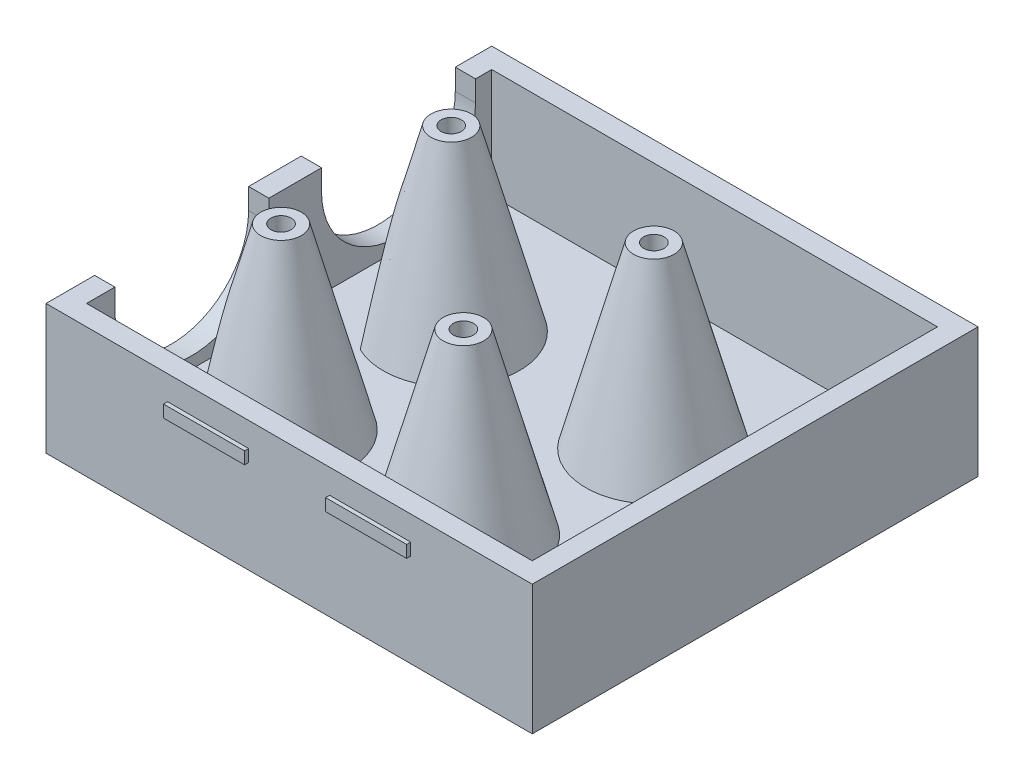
ISO-10303-21;
HEADER;
FILE_DESCRIPTION(('STEP AP214'),'2;1');
FILE_NAME('part.step','',(''),(''),'','','');
FILE_SCHEMA(('AUTOMOTIVE_DESIGN { 1 0 10303 214 1 1 1 1 }'));
ENDSEC;
DATA;
#1=APPLICATION_CONTEXT('core data for automotive mechanical design processes');
#2=APPLICATION_PROTOCOL_DEFINITION('international standard','automotive_design',2000,#1);
#3=PRODUCT_CONTEXT('',#1,'mechanical');
#4=PRODUCT('Part','Part','',(#3));
#5=PRODUCT_RELATED_PRODUCT_CATEGORY('part','',(#4));
#6=PRODUCT_DEFINITION_FORMATION('','',#4);
#7=PRODUCT_DEFINITION_CONTEXT('part definition',#1,'design');
#8=PRODUCT_DEFINITION('design','',#6,#7);
#9=PRODUCT_DEFINITION_SHAPE('','',#8);
#10=(LENGTH_UNIT() NAMED_UNIT(*) SI_UNIT(.MILLI.,.METRE.));
#11=(NAMED_UNIT(*) PLANE_ANGLE_UNIT() SI_UNIT($,.RADIAN.));
#12=(NAMED_UNIT(*) SI_UNIT($,.STERADIAN.) SOLID_ANGLE_UNIT());
#13=UNCERTAINTY_MEASURE_WITH_UNIT(LENGTH_MEASURE(1.E-05),#10,'distance_accuracy_value','');
#14=(GEOMETRIC_REPRESENTATION_CONTEXT(3) GLOBAL_UNCERTAINTY_ASSIGNED_CONTEXT((#13)) GLOBAL_UNIT_ASSIGNED_CONTEXT((#10,
#11,#12)) REPRESENTATION_CONTEXT('',''));
#15=CARTESIAN_POINT('',(0.,0.,0.));
#16=DIRECTION('',(0.,0.,1.));
#17=DIRECTION('',(1.,0.,0.));
#18=AXIS2_PLACEMENT_3D('',#15,#16,#17);
#19=CARTESIAN_POINT('',(-26.3578274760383,2.5,-41.2060702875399));
#20=DIRECTION('',(0.,0.,1.));
#21=DIRECTION('',(1.,0.,0.));
#22=AXIS2_PLACEMENT_3D('',#19,#20,#21);
#23=PLANE('',#22);
#24=DIRECTION('',(0.,-1.,0.));
#25=VECTOR('',#24,1.);
#26=CARTESIAN_POINT('',(-1.35782747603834,13.,-41.2060702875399));
#27=LINE('',#26,#25);
#28=CARTESIAN_POINT('',(-1.35782747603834,13.,-41.2060702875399));
#29=VERTEX_POINT('',#28);
#30=CARTESIAN_POINT('',(-1.35782747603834,11.5,-41.2060702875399));
#31=VERTEX_POINT('',#30);
#32=EDGE_CURVE('E808',#29,#31,#27,.T.);
#33=ORIENTED_EDGE('',*,*,#32,.F.);
#34=DIRECTION('',(1.,0.,0.));
#35=VECTOR('',#34,1.);
#36=CARTESIAN_POINT('',(-1.35782747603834,13.,-41.2060702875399));
#37=LINE('',#36,#35);
#38=CARTESIAN_POINT('',(-11.3578274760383,13.,-41.2060702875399));
#39=VERTEX_POINT('',#38);
#40=EDGE_CURVE('E798',#39,#29,#37,.T.);
#41=ORIENTED_EDGE('',*,*,#40,.F.);
#42=DIRECTION('',(0.,1.,0.));
#43=VECTOR('',#42,1.);
#44=CARTESIAN_POINT('',(-11.3578274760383,13.,-41.2060702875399));
#45=LINE('',#44,#43);
#46=CARTESIAN_POINT('',(-11.3578274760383,11.5,-41.2060702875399));
#47=VERTEX_POINT('',#46);
#48=EDGE_CURVE('E802',#47,#39,#45,.T.);
#49=ORIENTED_EDGE('',*,*,#48,.F.);
#50=DIRECTION('',(-1.,0.,0.));
#51=VECTOR('',#50,1.);
#52=CARTESIAN_POINT('',(-1.35782747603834,11.5,-41.2060702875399));
#53=LINE('',#52,#51);
#54=EDGE_CURVE('E805',#31,#47,#53,.T.);
#55=ORIENTED_EDGE('',*,*,#54,.F.);
#56=EDGE_LOOP('',(#33,#41,#49,#55));
#57=FACE_BOUND('',#56,.T.);
#58=DIRECTION('',(-1.,0.,0.));
#59=VECTOR('',#58,1.);
#60=CARTESIAN_POINT('',(-26.3578274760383,0.,-41.2060702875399));
#61=LINE('',#60,#59);
#62=CARTESIAN_POINT('',(33.6421725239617,0.,-41.2060702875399));
#63=VERTEX_POINT('',#62);
#64=CARTESIAN_POINT('',(-26.3578274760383,0.,-41.2060702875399));
#65=VERTEX_POINT('',#64);
#66=EDGE_CURVE('E352',#63,#65,#61,.T.);
#67=ORIENTED_EDGE('',*,*,#66,.T.);
#68=DIRECTION('',(0.,-1.,0.));
#69=VECTOR('',#68,1.);
#70=CARTESIAN_POINT('',(-26.3578274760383,2.5,-41.2060702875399));
#71=LINE('',#70,#69);
#72=CARTESIAN_POINT('',(-26.3578274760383,16.,-41.2060702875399));
#73=VERTEX_POINT('',#72);
#74=EDGE_CURVE('E354',#73,#65,#71,.T.);
#75=ORIENTED_EDGE('',*,*,#74,.F.);
#76=DIRECTION('',(-1.,0.,0.));
#77=VECTOR('',#76,1.);
#78=CARTESIAN_POINT('',(33.6421725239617,16.,-41.2060702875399));
#79=LINE('',#78,#77);
#80=CARTESIAN_POINT('',(33.6421725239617,16.,-41.2060702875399));
#81=VERTEX_POINT('',#80);
#82=EDGE_CURVE('E337',#81,#73,#79,.T.);
#83=ORIENTED_EDGE('',*,*,#82,.F.);
#84=DIRECTION('',(0.,-1.,0.));
#85=VECTOR('',#84,1.);
#86=CARTESIAN_POINT('',(33.6421725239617,2.5,-41.2060702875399));
#87=LINE('',#86,#85);
#88=EDGE_CURVE('E357',#81,#63,#87,.T.);
#89=ORIENTED_EDGE('',*,*,#88,.T.);
#90=EDGE_LOOP('',(#67,#75,#83,#89));
#91=FACE_BOUND('',#90,.T.);
#92=DIRECTION('',(0.,-1.,0.));
#93=VECTOR('',#92,1.);
#94=CARTESIAN_POINT('',(18.6421725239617,13.,-41.2060702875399));
#95=LINE('',#94,#93);
#96=CARTESIAN_POINT('',(18.6421725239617,13.,-41.2060702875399));
#97=VERTEX_POINT('',#96);
#98=CARTESIAN_POINT('',(18.6421725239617,11.5,-41.2060702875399));
#99=VERTEX_POINT('',#98);
#100=EDGE_CURVE('E516',#97,#99,#95,.T.);
#101=ORIENTED_EDGE('',*,*,#100,.F.);
#102=DIRECTION('',(1.,0.,0.));
#103=VECTOR('',#102,1.);
#104=CARTESIAN_POINT('',(18.6421725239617,13.,-41.2060702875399));
#105=LINE('',#104,#103);
#106=CARTESIAN_POINT('',(8.64217252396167,13.,-41.2060702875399));
#107=VERTEX_POINT('',#106);
#108=EDGE_CURVE('E831',#107,#97,#105,.T.);
#109=ORIENTED_EDGE('',*,*,#108,.F.);
#110=DIRECTION('',(0.,1.,0.));
#111=VECTOR('',#110,1.);
#112=CARTESIAN_POINT('',(8.64217252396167,13.,-41.2060702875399));
#113=LINE('',#112,#111);
#114=CARTESIAN_POINT('',(8.64217252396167,11.5,-41.2060702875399));
#115=VERTEX_POINT('',#114);
#116=EDGE_CURVE('E834',#115,#107,#113,.T.);
#117=ORIENTED_EDGE('',*,*,#116,.F.);
#118=DIRECTION('',(-1.,0.,0.));
#119=VECTOR('',#118,1.);
#120=CARTESIAN_POINT('',(18.6421725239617,11.5,-41.2060702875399));
#121=LINE('',#120,#119);
#122=EDGE_CURVE('E837',#99,#115,#121,.T.);
#123=ORIENTED_EDGE('',*,*,#122,.F.);
#124=EDGE_LOOP('',(#101,#109,#117,#123));
#125=FACE_BOUND('',#124,.T.);
#126=ADVANCED_FACE('F35',(#57,#91,#125),#23,.F.);
#127=CARTESIAN_POINT('',(-26.3578274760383,2.5,13.7939297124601));
#128=DIRECTION('',(0.,0.,-1.));
#129=DIRECTION('',(-1.,0.,0.));
#130=AXIS2_PLACEMENT_3D('',#127,#128,#129);
#131=PLANE('',#130);
#132=DIRECTION('',(0.,-1.,0.));
#133=VECTOR('',#132,1.);
#134=CARTESIAN_POINT('',(-11.3578274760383,13.,13.7939297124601));
#135=LINE('',#134,#133);
#136=CARTESIAN_POINT('',(-11.3578274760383,13.,13.7939297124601));
#137=VERTEX_POINT('',#136);
#138=CARTESIAN_POINT('',(-11.3578274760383,11.5,13.7939297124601));
#139=VERTEX_POINT('',#138);
#140=EDGE_CURVE('E742',#137,#139,#135,.T.);
#141=ORIENTED_EDGE('',*,*,#140,.F.);
#142=DIRECTION('',(-1.,0.,0.));
#143=VECTOR('',#142,1.);
#144=CARTESIAN_POINT('',(-11.3578274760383,13.,13.7939297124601));
#145=LINE('',#144,#143);
#146=CARTESIAN_POINT('',(-1.35782747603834,13.,13.7939297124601));
#147=VERTEX_POINT('',#146);
#148=EDGE_CURVE('E732',#147,#137,#145,.T.);
#149=ORIENTED_EDGE('',*,*,#148,.F.);
#150=DIRECTION('',(0.,1.,0.));
#151=VECTOR('',#150,1.);
#152=CARTESIAN_POINT('',(-1.35782747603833,13.,13.7939297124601));
#153=LINE('',#152,#151);
#154=CARTESIAN_POINT('',(-1.35782747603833,11.5,13.7939297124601));
#155=VERTEX_POINT('',#154);
#156=EDGE_CURVE('E736',#155,#147,#153,.T.);
#157=ORIENTED_EDGE('',*,*,#156,.F.);
#158=DIRECTION('',(1.,0.,0.));
#159=VECTOR('',#158,1.);
#160=CARTESIAN_POINT('',(-11.3578274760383,11.5,13.7939297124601));
#161=LINE('',#160,#159);
#162=EDGE_CURVE('E739',#139,#155,#161,.T.);
#163=ORIENTED_EDGE('',*,*,#162,.F.);
#164=EDGE_LOOP('',(#141,#149,#157,#163));
#165=FACE_BOUND('',#164,.T.);
#166=DIRECTION('',(1.,0.,0.));
#167=VECTOR('',#166,1.);
#168=CARTESIAN_POINT('',(-26.3578274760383,0.,13.7939297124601));
#169=LINE('',#168,#167);
#170=CARTESIAN_POINT('',(-26.3578274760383,0.,13.7939297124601));
#171=VERTEX_POINT('',#170);
#172=CARTESIAN_POINT('',(33.6421725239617,0.,13.7939297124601));
#173=VERTEX_POINT('',#172);
#174=EDGE_CURVE('E348',#171,#173,#169,.T.);
#175=ORIENTED_EDGE('',*,*,#174,.T.);
#176=DIRECTION('',(0.,-1.,0.));
#177=VECTOR('',#176,1.);
#178=CARTESIAN_POINT('',(33.6421725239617,2.5,13.7939297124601));
#179=LINE('',#178,#177);
#180=CARTESIAN_POINT('',(33.6421725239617,16.,13.7939297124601));
#181=VERTEX_POINT('',#180);
#182=EDGE_CURVE('E360',#181,#173,#179,.T.);
#183=ORIENTED_EDGE('',*,*,#182,.F.);
#184=DIRECTION('',(1.,0.,0.));
#185=VECTOR('',#184,1.);
#186=CARTESIAN_POINT('',(-26.3578274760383,16.,13.7939297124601));
#187=LINE('',#186,#185);
#188=CARTESIAN_POINT('',(-26.3578274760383,16.,13.7939297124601));
#189=VERTEX_POINT('',#188);
#190=EDGE_CURVE('E331',#189,#181,#187,.T.);
#191=ORIENTED_EDGE('',*,*,#190,.F.);
#192=DIRECTION('',(0.,-1.,0.));
#193=VECTOR('',#192,1.);
#194=CARTESIAN_POINT('',(-26.3578274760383,2.5,13.7939297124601));
#195=LINE('',#194,#193);
#196=EDGE_CURVE('E48',#189,#171,#195,.T.);
#197=ORIENTED_EDGE('',*,*,#196,.T.);
#198=EDGE_LOOP('',(#175,#183,#191,#197));
#199=FACE_BOUND('',#198,.T.);
#200=DIRECTION('',(0.,-1.,0.));
#201=VECTOR('',#200,1.);
#202=CARTESIAN_POINT('',(8.64217252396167,13.,13.7939297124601));
#203=LINE('',#202,#201);
#204=CARTESIAN_POINT('',(8.64217252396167,13.,13.7939297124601));
#205=VERTEX_POINT('',#204);
#206=CARTESIAN_POINT('',(8.64217252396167,11.5,13.7939297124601));
#207=VERTEX_POINT('',#206);
#208=EDGE_CURVE('E775',#205,#207,#203,.T.);
#209=ORIENTED_EDGE('',*,*,#208,.F.);
#210=DIRECTION('',(-1.,0.,0.));
#211=VECTOR('',#210,1.);
#212=CARTESIAN_POINT('',(8.64217252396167,13.,13.7939297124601));
#213=LINE('',#212,#211);
#214=CARTESIAN_POINT('',(18.6421725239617,13.,13.7939297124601));
#215=VERTEX_POINT('',#214);
#216=EDGE_CURVE('E765',#215,#205,#213,.T.);
#217=ORIENTED_EDGE('',*,*,#216,.F.);
#218=DIRECTION('',(0.,1.,0.));
#219=VECTOR('',#218,1.);
#220=CARTESIAN_POINT('',(18.6421725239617,13.,13.7939297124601));
#221=LINE('',#220,#219);
#222=CARTESIAN_POINT('',(18.6421725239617,11.5,13.7939297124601));
#223=VERTEX_POINT('',#222);
#224=EDGE_CURVE('E769',#223,#215,#221,.T.);
#225=ORIENTED_EDGE('',*,*,#224,.F.);
#226=DIRECTION('',(1.,0.,0.));
#227=VECTOR('',#226,1.);
#228=CARTESIAN_POINT('',(8.64217252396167,11.5,13.7939297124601));
#229=LINE('',#228,#227);
#230=EDGE_CURVE('E772',#207,#223,#229,.T.);
#231=ORIENTED_EDGE('',*,*,#230,.F.);
#232=EDGE_LOOP('',(#209,#217,#225,#231));
#233=FACE_BOUND('',#232,.T.);
#234=ADVANCED_FACE('F366',(#165,#199,#233),#131,.F.);
#235=CARTESIAN_POINT('',(0.,16.,0.));
#236=DIRECTION('',(0.,1.,0.));
#237=DIRECTION('',(0.,0.,1.));
#238=AXIS2_PLACEMENT_3D('',#235,#236,#237);
#239=PLANE('',#238);
#240=DIRECTION('',(-1.,0.,0.));
#241=VECTOR('',#240,1.);
#242=CARTESIAN_POINT('',(-1.34128471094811,16.,-11.2060702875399));
#243=LINE('',#242,#241);
#244=CARTESIAN_POINT('',(-23.8578274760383,16.,-11.2060702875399));
#245=VERTEX_POINT('',#244);
#246=CARTESIAN_POINT('',(-26.3578274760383,16.,-11.2060702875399));
#247=VERTEX_POINT('',#246);
#248=EDGE_CURVE('E396',#245,#247,#243,.T.);
#249=ORIENTED_EDGE('',*,*,#248,.F.);
#250=DIRECTION('',(0.,0.,1.));
#251=VECTOR('',#250,1.);
#252=CARTESIAN_POINT('',(-23.8578274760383,16.,-38.7060702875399));
#253=LINE('',#252,#251);
#254=CARTESIAN_POINT('',(-23.8578274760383,16.,-17.7060702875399));
#255=VERTEX_POINT('',#254);
#256=EDGE_CURVE('E313',#255,#245,#253,.T.);
#257=ORIENTED_EDGE('',*,*,#256,.F.);
#258=DIRECTION('',(-1.,0.,0.));
#259=VECTOR('',#258,1.);
#260=CARTESIAN_POINT('',(-1.34128471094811,16.,-17.7060702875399));
#261=LINE('',#260,#259);
#262=CARTESIAN_POINT('',(-26.3578274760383,16.,-17.7060702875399));
#263=VERTEX_POINT('',#262);
#264=EDGE_CURVE('E411',#255,#263,#261,.T.);
#265=ORIENTED_EDGE('',*,*,#264,.T.);
#266=DIRECTION('',(0.,0.,1.));
#267=VECTOR('',#266,1.);
#268=CARTESIAN_POINT('',(-26.3578274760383,16.,-41.2060702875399));
#269=LINE('',#268,#267);
#270=EDGE_CURVE('E345',#263,#247,#269,.T.);
#271=ORIENTED_EDGE('',*,*,#270,.T.);
#272=EDGE_LOOP('',(#249,#257,#265,#271));
#273=FACE_BOUND('',#272,.T.);
#274=ADVANCED_FACE('F442',(#273),#239,.T.);
#275=CARTESIAN_POINT('',(0.,2.5,0.));
#276=DIRECTION('',(0.,1.,0.));
#277=DIRECTION('',(0.,0.,1.));
#278=AXIS2_PLACEMENT_3D('',#275,#276,#277);
#279=PLANE('',#278);
#280=CARTESIAN_POINT('',(-11.8578274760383,2.5,-0.706070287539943));
#281=DIRECTION('',(0.,1.,0.));
#282=DIRECTION('',(0.,0.,1.));
#283=AXIS2_PLACEMENT_3D('',#280,#281,#282);
#284=CIRCLE('',#283,8.39488223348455);
#285=CARTESIAN_POINT('',(-15.5361207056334,2.5,6.8400682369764));
#286=VERTEX_POINT('',#285);
#287=CARTESIAN_POINT('',(-15.5361207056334,2.5,-8.25220881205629));
#288=VERTEX_POINT('',#287);
#289=EDGE_CURVE('E296',#286,#288,#284,.T.);
#290=ORIENTED_EDGE('',*,*,#289,.F.);
#291=DIRECTION('',(0.,0.,1.));
#292=VECTOR('',#291,1.);
#293=CARTESIAN_POINT('',(-15.5361207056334,2.5,-33.5871679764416));
#294=LINE('',#293,#292);
#295=EDGE_CURVE('E54',#288,#286,#294,.T.);
#296=ORIENTED_EDGE('',*,*,#295,.F.);
#297=EDGE_LOOP('',(#290,#296));
#298=FACE_BOUND('',#297,.T.);
#299=CARTESIAN_POINT('',(-11.8578274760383,2.5,-21.7060702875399));
#300=DIRECTION('',(0.,1.,0.));
#301=DIRECTION('',(0.,0.,1.));
#302=AXIS2_PLACEMENT_3D('',#299,#300,#301);
#303=CIRCLE('',#302,8.39488223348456);
#304=CARTESIAN_POINT('',(-15.5361207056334,2.5,-14.1599317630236));
#305=VERTEX_POINT('',#304);
#306=CARTESIAN_POINT('',(-15.5361207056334,2.5,-29.2522088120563));
#307=VERTEX_POINT('',#306);
#308=EDGE_CURVE('E265',#305,#307,#303,.T.);
#309=ORIENTED_EDGE('',*,*,#308,.F.);
#310=EDGE_CURVE('E61',#307,#305,#294,.T.);
#311=ORIENTED_EDGE('',*,*,#310,.F.);
#312=EDGE_LOOP('',(#309,#311));
#313=FACE_BOUND('',#312,.T.);
#314=CARTESIAN_POINT('',(10.6421725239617,2.5,-0.706070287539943));
#315=DIRECTION('',(0.,1.,0.));
#316=DIRECTION('',(0.,0.,1.));
#317=AXIS2_PLACEMENT_3D('',#314,#315,#316);
#318=CIRCLE('',#317,8.39488223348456);
#319=CARTESIAN_POINT('',(10.6421725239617,2.5,-9.1009525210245));
#320=VERTEX_POINT('',#319);
#321=EDGE_CURVE('E290',#320,#320,#318,.T.);
#322=ORIENTED_EDGE('',*,*,#321,.F.);
#323=EDGE_LOOP('',(#322));
#324=FACE_BOUND('',#323,.T.);
#325=DIRECTION('',(1.,0.,0.));
#326=VECTOR('',#325,1.);
#327=CARTESIAN_POINT('',(-23.8578274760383,2.5,11.2939297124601));
#328=LINE('',#327,#326);
#329=CARTESIAN_POINT('',(-23.8578274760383,2.5,11.2939297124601));
#330=VERTEX_POINT('',#329);
#331=CARTESIAN_POINT('',(31.1421725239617,2.5,11.2939297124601));
#332=VERTEX_POINT('',#331);
#333=EDGE_CURVE('E299',#330,#332,#328,.T.);
#334=ORIENTED_EDGE('',*,*,#333,.T.);
#335=DIRECTION('',(0.,0.,-1.));
#336=VECTOR('',#335,1.);
#337=CARTESIAN_POINT('',(31.1421725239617,2.5,11.2939297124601));
#338=LINE('',#337,#336);
#339=CARTESIAN_POINT('',(31.1421725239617,2.5,-38.7060702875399));
#340=VERTEX_POINT('',#339);
#341=EDGE_CURVE('E315',#332,#340,#338,.T.);
#342=ORIENTED_EDGE('',*,*,#341,.T.);
#343=DIRECTION('',(-1.,0.,0.));
#344=VECTOR('',#343,1.);
#345=CARTESIAN_POINT('',(31.1421725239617,2.5,-38.7060702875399));
#346=LINE('',#345,#344);
#347=CARTESIAN_POINT('',(-23.8578274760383,2.5,-38.7060702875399));
#348=VERTEX_POINT('',#347);
#349=EDGE_CURVE('E317',#340,#348,#346,.T.);
#350=ORIENTED_EDGE('',*,*,#349,.T.);
#351=DIRECTION('',(0.,0.,1.));
#352=VECTOR('',#351,1.);
#353=CARTESIAN_POINT('',(-23.8578274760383,2.5,-38.7060702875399));
#354=LINE('',#353,#352);
#355=EDGE_CURVE('E303',#348,#330,#354,.T.);
#356=ORIENTED_EDGE('',*,*,#355,.T.);
#357=EDGE_LOOP('',(#334,#342,#350,#356));
#358=FACE_BOUND('',#357,.T.);
#359=CARTESIAN_POINT('',(13.1421725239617,2.5,-21.7060702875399));
#360=DIRECTION('',(0.,1.,0.));
#361=DIRECTION('',(0.,0.,1.));
#362=AXIS2_PLACEMENT_3D('',#359,#360,#361);
#363=CIRCLE('',#362,8.39488223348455);
#364=CARTESIAN_POINT('',(13.1421725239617,2.5,-30.1009525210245));
#365=VERTEX_POINT('',#364);
#366=EDGE_CURVE('E275',#365,#365,#363,.T.);
#367=ORIENTED_EDGE('',*,*,#366,.F.);
#368=EDGE_LOOP('',(#367));
#369=FACE_BOUND('',#368,.T.);
#370=ADVANCED_FACE('F266',(#298,#313,#324,#358,#369),#279,.T.);
#371=CARTESIAN_POINT('',(-26.3578274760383,2.5,-41.2060702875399));
#372=DIRECTION('',(1.,0.,0.));
#373=DIRECTION('',(0.,0.,-1.));
#374=AXIS2_PLACEMENT_3D('',#371,#372,#373);
#375=PLANE('',#374);
#376=CARTESIAN_POINT('',(-26.3578274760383,13.4171734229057,-1.70607028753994));
#377=DIRECTION('',(-1.,0.,0.));
#378=DIRECTION('',(0.,0.,1.));
#379=AXIS2_PLACEMENT_3D('',#376,#377,#378);
#380=CIRCLE('',#379,9.5);
#381=CARTESIAN_POINT('',(-26.3578274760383,13.4171734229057,-11.2060702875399));
#382=VERTEX_POINT('',#381);
#383=CARTESIAN_POINT('',(-26.3578274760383,13.4171734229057,7.79392971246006));
#384=VERTEX_POINT('',#383);
#385=EDGE_CURVE('E702',#382,#384,#380,.T.);
#386=ORIENTED_EDGE('',*,*,#385,.F.);
#387=DIRECTION('',(0.,-1.,0.));
#388=VECTOR('',#387,1.);
#389=CARTESIAN_POINT('',(-26.3578274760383,16.,-11.2060702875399));
#390=LINE('',#389,#388);
#391=EDGE_CURVE('E699',#247,#382,#390,.T.);
#392=ORIENTED_EDGE('',*,*,#391,.F.);
#393=ORIENTED_EDGE('',*,*,#270,.F.);
#394=DIRECTION('',(0.,1.,0.));
#395=VECTOR('',#394,1.);
#396=CARTESIAN_POINT('',(-26.3578274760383,16.,-17.7060702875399));
#397=LINE('',#396,#395);
#398=CARTESIAN_POINT('',(-26.3578274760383,13.4171734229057,-17.7060702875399));
#399=VERTEX_POINT('',#398);
#400=EDGE_CURVE('E398',#399,#263,#397,.T.);
#401=ORIENTED_EDGE('',*,*,#400,.F.);
#402=CARTESIAN_POINT('',(-26.3578274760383,13.4171734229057,-27.2060702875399));
#403=DIRECTION('',(-1.,0.,0.));
#404=DIRECTION('',(0.,0.,1.));
#405=AXIS2_PLACEMENT_3D('',#402,#403,#404);
#406=CIRCLE('',#405,9.5);
#407=CARTESIAN_POINT('',(-26.3578274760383,13.4171734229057,-36.7060702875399));
#408=VERTEX_POINT('',#407);
#409=EDGE_CURVE('E393',#408,#399,#406,.T.);
#410=ORIENTED_EDGE('',*,*,#409,.F.);
#411=DIRECTION('',(0.,-1.,0.));
#412=VECTOR('',#411,1.);
#413=CARTESIAN_POINT('',(-26.3578274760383,16.,-36.7060702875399));
#414=LINE('',#413,#412);
#415=CARTESIAN_POINT('',(-26.3578274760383,16.,-36.7060702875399));
#416=VERTEX_POINT('',#415);
#417=EDGE_CURVE('E390',#416,#408,#414,.T.);
#418=ORIENTED_EDGE('',*,*,#417,.F.);
#419=EDGE_CURVE('E341',#73,#416,#269,.T.);
#420=ORIENTED_EDGE('',*,*,#419,.F.);
#421=ORIENTED_EDGE('',*,*,#74,.T.);
#422=DIRECTION('',(0.,0.,1.));
#423=VECTOR('',#422,1.);
#424=CARTESIAN_POINT('',(-26.3578274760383,0.,-41.2060702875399));
#425=LINE('',#424,#423);
#426=EDGE_CURVE('E344',#65,#171,#425,.T.);
#427=ORIENTED_EDGE('',*,*,#426,.T.);
#428=ORIENTED_EDGE('',*,*,#196,.F.);
#429=CARTESIAN_POINT('',(-26.3578274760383,16.,7.79392971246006));
#430=VERTEX_POINT('',#429);
#431=EDGE_CURVE('E340',#430,#189,#269,.T.);
#432=ORIENTED_EDGE('',*,*,#431,.F.);
#433=DIRECTION('',(0.,1.,0.));
#434=VECTOR('',#433,1.);
#435=CARTESIAN_POINT('',(-26.3578274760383,16.,7.79392971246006));
#436=LINE('',#435,#434);
#437=EDGE_CURVE('E705',#384,#430,#436,.T.);
#438=ORIENTED_EDGE('',*,*,#437,.F.);
#439=EDGE_LOOP('',(#386,#392,#393,#401,#410,#418,#420,#421,#427,#428,#432,#438));
#440=FACE_BOUND('',#439,.T.);
#441=ADVANCED_FACE('F37',(#440),#375,.F.);
#442=CARTESIAN_POINT('',(33.6421725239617,2.5,-41.2060702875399));
#443=DIRECTION('',(-1.,0.,0.));
#444=DIRECTION('',(0.,0.,1.));
#445=AXIS2_PLACEMENT_3D('',#442,#443,#444);
#446=PLANE('',#445);
#447=DIRECTION('',(0.,0.,-1.));
#448=VECTOR('',#447,1.);
#449=CARTESIAN_POINT('',(33.6421725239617,0.,-41.2060702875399));
#450=LINE('',#449,#448);
#451=EDGE_CURVE('E350',#173,#63,#450,.T.);
#452=ORIENTED_EDGE('',*,*,#451,.T.);
#453=ORIENTED_EDGE('',*,*,#88,.F.);
#454=DIRECTION('',(0.,0.,-1.));
#455=VECTOR('',#454,1.);
#456=CARTESIAN_POINT('',(33.6421725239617,16.,13.7939297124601));
#457=LINE('',#456,#455);
#458=EDGE_CURVE('E334',#181,#81,#457,.T.);
#459=ORIENTED_EDGE('',*,*,#458,.F.);
#460=ORIENTED_EDGE('',*,*,#182,.T.);
#461=EDGE_LOOP('',(#452,#453,#459,#460));
#462=FACE_BOUND('',#461,.T.);
#463=ADVANCED_FACE('F378',(#462),#446,.F.);
#464=CARTESIAN_POINT('',(0.,0.,0.));
#465=DIRECTION('',(0.,1.,0.));
#466=DIRECTION('',(0.,0.,1.));
#467=AXIS2_PLACEMENT_3D('',#464,#465,#466);
#468=PLANE('',#467);
#469=ORIENTED_EDGE('',*,*,#426,.F.);
#470=ORIENTED_EDGE('',*,*,#66,.F.);
#471=ORIENTED_EDGE('',*,*,#451,.F.);
#472=ORIENTED_EDGE('',*,*,#174,.F.);
#473=EDGE_LOOP('',(#469,#470,#471,#472));
#474=FACE_BOUND('',#473,.T.);
#475=ADVANCED_FACE('F375',(#474),#468,.F.);
#476=DIRECTION('',(-1.,0.,0.));
#477=VECTOR('',#476,1.);
#478=CARTESIAN_POINT('',(-1.34128471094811,16.,7.79392971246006));
#479=LINE('',#478,#477);
#480=CARTESIAN_POINT('',(-23.8578274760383,16.,7.79392971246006));
#481=VERTEX_POINT('',#480);
#482=EDGE_CURVE('E400',#481,#430,#479,.T.);
#483=ORIENTED_EDGE('',*,*,#482,.T.);
#484=ORIENTED_EDGE('',*,*,#431,.T.);
#485=ORIENTED_EDGE('',*,*,#190,.T.);
#486=ORIENTED_EDGE('',*,*,#458,.T.);
#487=ORIENTED_EDGE('',*,*,#82,.T.);
#488=ORIENTED_EDGE('',*,*,#419,.T.);
#489=DIRECTION('',(-1.,0.,0.));
#490=VECTOR('',#489,1.);
#491=CARTESIAN_POINT('',(-1.34128471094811,16.,-36.7060702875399));
#492=LINE('',#491,#490);
#493=CARTESIAN_POINT('',(-23.8578274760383,16.,-36.7060702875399));
#494=VERTEX_POINT('',#493);
#495=EDGE_CURVE('E418',#494,#416,#492,.T.);
#496=ORIENTED_EDGE('',*,*,#495,.F.);
#497=CARTESIAN_POINT('',(-23.8578274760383,16.,-38.7060702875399));
#498=VERTEX_POINT('',#497);
#499=EDGE_CURVE('E309',#498,#494,#253,.T.);
#500=ORIENTED_EDGE('',*,*,#499,.F.);
#501=DIRECTION('',(-1.,0.,0.));
#502=VECTOR('',#501,1.);
#503=CARTESIAN_POINT('',(31.1421725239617,16.,-38.7060702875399));
#504=LINE('',#503,#502);
#505=CARTESIAN_POINT('',(31.1421725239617,16.,-38.7060702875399));
#506=VERTEX_POINT('',#505);
#507=EDGE_CURVE('E305',#506,#498,#504,.T.);
#508=ORIENTED_EDGE('',*,*,#507,.F.);
#509=DIRECTION('',(0.,0.,-1.));
#510=VECTOR('',#509,1.);
#511=CARTESIAN_POINT('',(31.1421725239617,16.,11.2939297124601));
#512=LINE('',#511,#510);
#513=CARTESIAN_POINT('',(31.1421725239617,16.,11.2939297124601));
#514=VERTEX_POINT('',#513);
#515=EDGE_CURVE('E302',#514,#506,#512,.T.);
#516=ORIENTED_EDGE('',*,*,#515,.F.);
#517=DIRECTION('',(1.,0.,0.));
#518=VECTOR('',#517,1.);
#519=CARTESIAN_POINT('',(-23.8578274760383,16.,11.2939297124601));
#520=LINE('',#519,#518);
#521=CARTESIAN_POINT('',(-23.8578274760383,16.,11.2939297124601));
#522=VERTEX_POINT('',#521);
#523=EDGE_CURVE('E300',#522,#514,#520,.T.);
#524=ORIENTED_EDGE('',*,*,#523,.F.);
#525=EDGE_CURVE('E308',#481,#522,#253,.T.);
#526=ORIENTED_EDGE('',*,*,#525,.F.);
#527=EDGE_LOOP('',(#483,#484,#485,#486,#487,#488,#496,#500,#508,#516,#524,#526));
#528=FACE_BOUND('',#527,.T.);
#529=ADVANCED_FACE('F385',(#528),#239,.T.);
#530=CARTESIAN_POINT('',(-23.8578274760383,16.,11.2939297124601));
#531=DIRECTION('',(0.,0.,-1.));
#532=DIRECTION('',(-1.,0.,0.));
#533=AXIS2_PLACEMENT_3D('',#530,#531,#532);
#534=PLANE('',#533);
#535=ORIENTED_EDGE('',*,*,#333,.F.);
#536=DIRECTION('',(0.,-1.,0.));
#537=VECTOR('',#536,1.);
#538=CARTESIAN_POINT('',(-23.8578274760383,16.,11.2939297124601));
#539=LINE('',#538,#537);
#540=EDGE_CURVE('E312',#522,#330,#539,.T.);
#541=ORIENTED_EDGE('',*,*,#540,.F.);
#542=ORIENTED_EDGE('',*,*,#523,.T.);
#543=DIRECTION('',(0.,-1.,0.));
#544=VECTOR('',#543,1.);
#545=CARTESIAN_POINT('',(31.1421725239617,16.,11.2939297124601));
#546=LINE('',#545,#544);
#547=EDGE_CURVE('E328',#514,#332,#546,.T.);
#548=ORIENTED_EDGE('',*,*,#547,.T.);
#549=EDGE_LOOP('',(#535,#541,#542,#548));
#550=FACE_BOUND('',#549,.T.);
#551=ADVANCED_FACE('F466',(#550),#534,.T.);
#552=CARTESIAN_POINT('',(31.1421725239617,16.,11.2939297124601));
#553=DIRECTION('',(-1.,0.,0.));
#554=DIRECTION('',(0.,0.,1.));
#555=AXIS2_PLACEMENT_3D('',#552,#553,#554);
#556=PLANE('',#555);
#557=ORIENTED_EDGE('',*,*,#341,.F.);
#558=ORIENTED_EDGE('',*,*,#547,.F.);
#559=ORIENTED_EDGE('',*,*,#515,.T.);
#560=DIRECTION('',(0.,-1.,0.));
#561=VECTOR('',#560,1.);
#562=CARTESIAN_POINT('',(31.1421725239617,16.,-38.7060702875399));
#563=LINE('',#562,#561);
#564=EDGE_CURVE('E325',#506,#340,#563,.T.);
#565=ORIENTED_EDGE('',*,*,#564,.T.);
#566=EDGE_LOOP('',(#557,#558,#559,#565));
#567=FACE_BOUND('',#566,.T.);
#568=ADVANCED_FACE('F470',(#567),#556,.T.);
#569=CARTESIAN_POINT('',(31.1421725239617,16.,-38.7060702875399));
#570=DIRECTION('',(0.,0.,1.));
#571=DIRECTION('',(1.,0.,0.));
#572=AXIS2_PLACEMENT_3D('',#569,#570,#571);
#573=PLANE('',#572);
#574=ORIENTED_EDGE('',*,*,#349,.F.);
#575=ORIENTED_EDGE('',*,*,#564,.F.);
#576=ORIENTED_EDGE('',*,*,#507,.T.);
#577=DIRECTION('',(0.,-1.,0.));
#578=VECTOR('',#577,1.);
#579=CARTESIAN_POINT('',(-23.8578274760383,16.,-38.7060702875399));
#580=LINE('',#579,#578);
#581=EDGE_CURVE('E322',#498,#348,#580,.T.);
#582=ORIENTED_EDGE('',*,*,#581,.T.);
#583=EDGE_LOOP('',(#574,#575,#576,#582));
#584=FACE_BOUND('',#583,.T.);
#585=ADVANCED_FACE('F476',(#584),#573,.T.);
#586=CARTESIAN_POINT('',(-23.8578274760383,16.,-38.7060702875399));
#587=DIRECTION('',(1.,0.,0.));
#588=DIRECTION('',(0.,0.,-1.));
#589=AXIS2_PLACEMENT_3D('',#586,#587,#588);
#590=PLANE('',#589);
#591=DIRECTION('',(0.,-1.,0.));
#592=VECTOR('',#591,1.);
#593=CARTESIAN_POINT('',(-23.8578274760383,16.,-11.2060702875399));
#594=LINE('',#593,#592);
#595=CARTESIAN_POINT('',(-23.8578274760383,13.4171734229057,-11.2060702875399));
#596=VERTEX_POINT('',#595);
#597=EDGE_CURVE('E692',#245,#596,#594,.T.);
#598=ORIENTED_EDGE('',*,*,#597,.T.);
#599=CARTESIAN_POINT('',(-23.8578274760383,13.4171734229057,-1.70607028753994));
#600=DIRECTION('',(1.,0.,0.));
#601=DIRECTION('',(0.,0.,-1.));
#602=AXIS2_PLACEMENT_3D('',#599,#600,#601);
#603=CIRCLE('',#602,9.5);
#604=CARTESIAN_POINT('',(-23.8578274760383,13.4171734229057,7.79392971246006));
#605=VERTEX_POINT('',#604);
#606=EDGE_CURVE('E716',#596,#605,#603,.F.);
#607=ORIENTED_EDGE('',*,*,#606,.T.);
#608=DIRECTION('',(0.,1.,0.));
#609=VECTOR('',#608,1.);
#610=CARTESIAN_POINT('',(-23.8578274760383,16.,7.79392971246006));
#611=LINE('',#610,#609);
#612=EDGE_CURVE('E689',#605,#481,#611,.T.);
#613=ORIENTED_EDGE('',*,*,#612,.T.);
#614=ORIENTED_EDGE('',*,*,#525,.T.);
#615=ORIENTED_EDGE('',*,*,#540,.T.);
#616=ORIENTED_EDGE('',*,*,#355,.F.);
#617=ORIENTED_EDGE('',*,*,#581,.F.);
#618=ORIENTED_EDGE('',*,*,#499,.T.);
#619=DIRECTION('',(0.,-1.,0.));
#620=VECTOR('',#619,1.);
#621=CARTESIAN_POINT('',(-23.8578274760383,16.,-36.7060702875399));
#622=LINE('',#621,#620);
#623=CARTESIAN_POINT('',(-23.8578274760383,13.4171734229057,-36.7060702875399));
#624=VERTEX_POINT('',#623);
#625=EDGE_CURVE('E404',#494,#624,#622,.T.);
#626=ORIENTED_EDGE('',*,*,#625,.T.);
#627=CARTESIAN_POINT('',(-23.8578274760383,13.4171734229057,-27.2060702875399));
#628=DIRECTION('',(1.,0.,0.));
#629=DIRECTION('',(0.,0.,-1.));
#630=AXIS2_PLACEMENT_3D('',#627,#628,#629);
#631=CIRCLE('',#630,9.5);
#632=CARTESIAN_POINT('',(-23.8578274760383,13.4171734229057,-17.7060702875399));
#633=VERTEX_POINT('',#632);
#634=EDGE_CURVE('E413',#624,#633,#631,.F.);
#635=ORIENTED_EDGE('',*,*,#634,.T.);
#636=DIRECTION('',(0.,1.,0.));
#637=VECTOR('',#636,1.);
#638=CARTESIAN_POINT('',(-23.8578274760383,16.,-17.7060702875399));
#639=LINE('',#638,#637);
#640=EDGE_CURVE('E408',#633,#255,#639,.T.);
#641=ORIENTED_EDGE('',*,*,#640,.T.);
#642=ORIENTED_EDGE('',*,*,#256,.T.);
#643=EDGE_LOOP('',(#598,#607,#613,#614,#615,#616,#617,#618,#626,#635,#641,#642));
#644=FACE_BOUND('',#643,.T.);
#645=ADVANCED_FACE('F480',(#644),#590,.T.);
#646=CARTESIAN_POINT('',(-11.8578274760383,2.5,-0.706070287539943));
#647=DIRECTION('',(0.,-1.,0.));
#648=DIRECTION('',(0.,0.,-1.));
#649=AXIS2_PLACEMENT_3D('',#646,#647,#648);
#650=CONICAL_SURFACE('',#649,8.39488223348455,0.261799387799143);
#651=CARTESIAN_POINT('',(-11.8578274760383,24.5,-0.706070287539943));
#652=DIRECTION('',(0.,1.,0.));
#653=DIRECTION('',(0.,0.,1.));
#654=AXIS2_PLACEMENT_3D('',#651,#652,#653);
#655=CIRCLE('',#654,2.50000000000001);
#656=CARTESIAN_POINT('',(-11.8578274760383,24.5,1.79392971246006));
#657=VERTEX_POINT('',#656);
#658=EDGE_CURVE('E293',#657,#657,#655,.T.);
#659=ORIENTED_EDGE('',*,*,#658,.F.);
#660=EDGE_LOOP('',(#659));
#661=FACE_BOUND('',#660,.T.);
#662=ORIENTED_EDGE('',*,*,#289,.T.);
#663=CARTESIAN_POINT('',(-15.5361207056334,-8.03524108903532,-11.3036646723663));
#664=CARTESIAN_POINT('',(-15.5361207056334,-7.52819371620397,-11.1598490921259));
#665=CARTESIAN_POINT('',(-15.5361207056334,-7.02122805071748,-11.0157455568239));
#666=CARTESIAN_POINT('',(-15.5361207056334,-6.00748442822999,-10.7268778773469));
#667=CARTESIAN_POINT('',(-15.5361207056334,-5.50070647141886,-10.5821137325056));
#668=CARTESIAN_POINT('',(-15.5361207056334,-3.98053388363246,-10.146658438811));
#669=CARTESIAN_POINT('',(-15.5361207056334,-2.96745892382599,-9.85484929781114));
#670=CARTESIAN_POINT('',(-15.5361207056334,-0.942164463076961,-9.26721644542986));
#671=CARTESIAN_POINT('',(-15.5361207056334,0.0700547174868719,-8.97139162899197));
#672=CARTESIAN_POINT('',(-15.5361207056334,2.09277820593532,-8.37443878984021));
#673=CARTESIAN_POINT('',(-15.5361207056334,3.10328273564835,-8.07331152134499));
#674=CARTESIAN_POINT('',(-15.5361207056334,4.61724194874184,-7.615911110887));
#675=CARTESIAN_POINT('',(-15.5361207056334,5.12156205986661,-7.46250307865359));
#676=CARTESIAN_POINT('',(-15.5361207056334,6.12948318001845,-7.15334430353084));
#677=CARTESIAN_POINT('',(-15.5361207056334,6.63308419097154,-6.9975935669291));
#678=CARTESIAN_POINT('',(-15.5361207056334,7.63959945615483,-6.6831302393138));
#679=CARTESIAN_POINT('',(-15.5361207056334,8.14251332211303,-6.52441640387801));
#680=CARTESIAN_POINT('',(-15.5361207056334,9.14716354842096,-6.2033348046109));
#681=CARTESIAN_POINT('',(-15.5361207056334,9.64889993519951,-6.04096712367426));
#682=CARTESIAN_POINT('',(-15.5361207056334,10.6516417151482,-5.71122430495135));
#683=CARTESIAN_POINT('',(-15.5361207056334,11.152644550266,-5.54384137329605));
#684=CARTESIAN_POINT('',(-15.5361207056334,12.1525515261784,-5.20272635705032));
#685=CARTESIAN_POINT('',(-15.5361207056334,12.6514554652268,-5.02899367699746));
#686=CARTESIAN_POINT('',(-15.5361207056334,13.3972212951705,-4.76181010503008));
#687=CARTESIAN_POINT('',(-15.5361207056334,13.6452762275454,-4.67169009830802));
#688=CARTESIAN_POINT('',(-15.5361207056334,14.1403898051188,-4.48875754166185));
#689=CARTESIAN_POINT('',(-15.5361207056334,14.3874484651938,-4.39594503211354));
#690=CARTESIAN_POINT('',(-15.5361207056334,14.8802628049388,-4.20703452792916));
#691=CARTESIAN_POINT('',(-15.5361207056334,15.1260186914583,-4.11093707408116));
#692=CARTESIAN_POINT('',(-15.5361207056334,15.6158702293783,-3.9146117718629));
#693=CARTESIAN_POINT('',(-15.5361207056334,15.8599659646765,-3.81438413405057));
#694=CARTESIAN_POINT('',(-15.5361207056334,16.2249627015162,-3.65980933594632));
#695=CARTESIAN_POINT('',(-15.5361207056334,16.3467079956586,-3.60745704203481));
#696=CARTESIAN_POINT('',(-15.5361207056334,16.5895148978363,-3.50119031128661));
#697=CARTESIAN_POINT('',(-15.5361207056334,16.7105764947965,-3.44727584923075));
#698=CARTESIAN_POINT('',(-15.5361207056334,17.0727327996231,-3.28276353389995));
#699=CARTESIAN_POINT('',(-15.5361207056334,17.3126267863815,-3.1694689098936));
#700=CARTESIAN_POINT('',(-15.5361207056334,17.6683349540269,-2.99215239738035));
#701=CARTESIAN_POINT('',(-15.5361207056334,17.7860375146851,-2.93191616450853));
#702=CARTESIAN_POINT('',(-15.5361207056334,18.0198229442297,-2.80838678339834));
#703=CARTESIAN_POINT('',(-15.5361207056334,18.1359059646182,-2.74509392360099));
#704=CARTESIAN_POINT('',(-15.5361207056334,18.365818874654,-2.61480710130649));
#705=CARTESIAN_POINT('',(-15.5361207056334,18.479651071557,-2.54781722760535));
#706=CARTESIAN_POINT('',(-15.5361207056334,18.7043799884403,-2.40910646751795));
#707=CARTESIAN_POINT('',(-15.5361207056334,18.8152776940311,-2.33738719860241));
#708=CARTESIAN_POINT('',(-15.5361207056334,18.9875384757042,-2.21893771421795));
#709=CARTESIAN_POINT('',(-15.5361207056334,19.0502969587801,-2.17423931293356));
#710=CARTESIAN_POINT('',(-15.5361207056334,19.1739887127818,-2.08233974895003));
#711=CARTESIAN_POINT('',(-15.5361207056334,19.234921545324,-2.03513799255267));
#712=CARTESIAN_POINT('',(-15.5361207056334,19.354326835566,-1.93781566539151));
#713=CARTESIAN_POINT('',(-15.5361207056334,19.4128016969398,-1.88769806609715));
#714=CARTESIAN_POINT('',(-15.5361207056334,19.5265039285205,-1.78392910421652));
#715=CARTESIAN_POINT('',(-15.5361207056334,19.58173288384,-1.73027949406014));
#716=CARTESIAN_POINT('',(-15.5361207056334,19.6952174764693,-1.61085830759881));
#717=CARTESIAN_POINT('',(-15.5361207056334,19.7528069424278,-1.54444293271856));
#718=CARTESIAN_POINT('',(-15.5361207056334,19.8593246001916,-1.40488716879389));
#719=CARTESIAN_POINT('',(-15.5361207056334,19.9082623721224,-1.33175435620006));
#720=CARTESIAN_POINT('',(-15.5361207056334,19.9819561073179,-1.19792583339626));
#721=CARTESIAN_POINT('',(-15.5361207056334,20.0096929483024,-1.1389017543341));
#722=CARTESIAN_POINT('',(-15.5361207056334,20.0553786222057,-1.01718232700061));
#723=CARTESIAN_POINT('',(-15.5361207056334,20.0733454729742,-0.954493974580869));
#724=CARTESIAN_POINT('',(-15.5361207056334,20.0973443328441,-0.826077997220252));
#725=CARTESIAN_POINT('',(-15.5361207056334,20.1032452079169,-0.760324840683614));
#726=CARTESIAN_POINT('',(-15.5361207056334,20.1017219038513,-0.628961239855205));
#727=CARTESIAN_POINT('',(-15.5361207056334,20.0942953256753,-0.563350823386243));
#728=CARTESIAN_POINT('',(-15.5361207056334,20.0692840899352,-0.44395821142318));
#729=CARTESIAN_POINT('',(-15.5361207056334,20.0532985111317,-0.389823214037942));
#730=CARTESIAN_POINT('',(-15.5361207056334,20.0139991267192,-0.2843258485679));
#731=CARTESIAN_POINT('',(-15.5361207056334,19.9906828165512,-0.232964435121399));
#732=CARTESIAN_POINT('',(-15.5361207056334,19.9162087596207,-0.0911498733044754));
#733=CARTESIAN_POINT('',(-15.5361207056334,19.8581752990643,-0.0043452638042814));
#734=CARTESIAN_POINT('',(-15.5361207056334,19.7302940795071,0.160098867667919));
#735=CARTESIAN_POINT('',(-15.5361207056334,19.6603999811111,0.237700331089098));
#736=CARTESIAN_POINT('',(-15.5361207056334,19.5317640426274,0.366934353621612));
#737=CARTESIAN_POINT('',(-15.5361207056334,19.474627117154,0.420195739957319));
#738=CARTESIAN_POINT('',(-15.5361207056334,19.3573106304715,0.523275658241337));
#739=CARTESIAN_POINT('',(-15.5361207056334,19.2971298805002,0.573092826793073));
#740=CARTESIAN_POINT('',(-15.5361207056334,19.1130025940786,0.718450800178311));
#741=CARTESIAN_POINT('',(-15.5361207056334,18.9856806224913,0.809698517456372));
#742=CARTESIAN_POINT('',(-15.5361207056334,18.724859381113,0.984605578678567));
#743=CARTESIAN_POINT('',(-15.5361207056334,18.591325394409,1.06821185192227));
#744=CARTESIAN_POINT('',(-15.5361207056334,18.3883942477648,1.18896764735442));
#745=CARTESIAN_POINT('',(-15.5361207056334,18.3203536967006,1.22842174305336));
#746=CARTESIAN_POINT('',(-15.5361207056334,18.1835129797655,1.30598426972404));
#747=CARTESIAN_POINT('',(-15.5361207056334,18.11471283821,1.34409274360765));
#748=CARTESIAN_POINT('',(-15.5361207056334,17.8881883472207,1.46706568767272));
#749=CARTESIAN_POINT('',(-15.5361207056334,17.7291307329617,1.54947632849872));
#750=CARTESIAN_POINT('',(-15.5361207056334,17.4086833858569,1.70964976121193));
#751=CARTESIAN_POINT('',(-15.5361207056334,17.2472932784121,1.78741179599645));
#752=CARTESIAN_POINT('',(-15.5361207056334,16.922711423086,1.93928629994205));
#753=CARTESIAN_POINT('',(-15.5361207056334,16.759518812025,2.01339691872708));
#754=CARTESIAN_POINT('',(-15.5361207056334,16.431805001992,2.15862682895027));
#755=CARTESIAN_POINT('',(-15.5361207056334,16.267283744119,2.22974598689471));
#756=CARTESIAN_POINT('',(-15.5361207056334,15.771452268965,2.43972867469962));
#757=CARTESIAN_POINT('',(-15.5361207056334,15.438577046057,2.57489487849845));
#758=CARTESIAN_POINT('',(-15.5361207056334,14.7701969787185,2.83819302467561));
#759=CARTESIAN_POINT('',(-15.5361207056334,14.434692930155,2.96632700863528));
#760=CARTESIAN_POINT('',(-15.5361207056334,13.7619660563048,3.21726502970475));
#761=CARTESIAN_POINT('',(-15.5361207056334,13.4247445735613,3.34007267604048));
#762=CARTESIAN_POINT('',(-15.5361207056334,12.7488351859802,3.58164692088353));
#763=CARTESIAN_POINT('',(-15.5361207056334,12.4101471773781,3.70041322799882));
#764=CARTESIAN_POINT('',(-15.5361207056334,11.7321108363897,3.93457310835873));
#765=CARTESIAN_POINT('',(-15.5361207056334,11.3927639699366,4.04997093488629));
#766=CARTESIAN_POINT('',(-15.5361207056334,10.7132051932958,4.27815441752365));
#767=CARTESIAN_POINT('',(-15.5361207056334,10.3729933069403,4.39094014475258));
#768=CARTESIAN_POINT('',(-15.5361207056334,9.34965484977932,4.72663468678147));
#769=CARTESIAN_POINT('',(-15.5361207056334,8.66547055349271,4.94631823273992));
#770=CARTESIAN_POINT('',(-15.5361207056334,7.29518140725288,5.37962235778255));
#771=CARTESIAN_POINT('',(-15.5361207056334,6.60907652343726,5.59324282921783));
#772=CARTESIAN_POINT('',(-15.5361207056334,5.23543912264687,6.01598563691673));
#773=CARTESIAN_POINT('',(-15.5361207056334,4.54790652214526,6.22510770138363));
#774=CARTESIAN_POINT('',(-15.5361207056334,3.17180116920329,6.6399023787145));
#775=CARTESIAN_POINT('',(-15.5361207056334,2.48322841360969,6.84557498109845));
#776=CARTESIAN_POINT('',(-15.5361207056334,1.10471214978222,7.25438100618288));
#777=CARTESIAN_POINT('',(-15.5361207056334,0.414767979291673,7.45751219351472));
#778=CARTESIAN_POINT('',(-15.5361207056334,-0.965757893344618,7.8615983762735));
#779=CARTESIAN_POINT('',(-15.5361207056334,-1.65633959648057,8.06255336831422));
#780=CARTESIAN_POINT('',(-15.5361207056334,-3.7287983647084,8.66276683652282));
#781=CARTESIAN_POINT('',(-15.5361207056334,-5.11143893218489,9.05938851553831));
#782=CARTESIAN_POINT('',(-15.5361207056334,-7.84954334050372,9.83965318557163));
#783=CARTESIAN_POINT('',(-15.5361207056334,-9.20497906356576,10.223395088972));
#784=CARTESIAN_POINT('',(-15.5361207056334,-11.9168233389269,10.9874831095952));
#785=CARTESIAN_POINT('',(-15.5361207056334,-13.2732319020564,11.3678291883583));
#786=CARTESIAN_POINT('',(-15.5361207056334,-15.9852563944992,12.1255539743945));
#787=CARTESIAN_POINT('',(-15.5361207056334,-17.3408715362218,12.5029355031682));
#788=CARTESIAN_POINT('',(-15.5361207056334,-20.0526373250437,13.2556955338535));
#789=CARTESIAN_POINT('',(-15.5361207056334,-21.4087879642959,13.6310740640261));
#790=CARTESIAN_POINT('',(-15.5361207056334,-22.7651385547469,14.0057257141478));
#791=B_SPLINE_CURVE_WITH_KNOTS('',3,(#663,#664,#665,#666,#667,#668,#669,#670,#671,#672,#673,
#674,#675,#676,#677,#678,#679,#680,#681,#682,#683,#684,#685,#686,#687,#688,#689,#690,#691,#692,
#693,#694,#695,#696,#697,#698,#699,#700,#701,#702,#703,#704,#705,#706,#707,#708,#709,#710,#711,
#712,#713,#714,#715,#716,#717,#718,#719,#720,#721,#722,#723,#724,#725,#726,#727,#728,#729,#730,
#731,#732,#733,#734,#735,#736,#737,#738,#739,#740,#741,#742,#743,#744,#745,#746,#747,#748,#749,
#750,#751,#752,#753,#754,#755,#756,#757,#758,#759,#760,#761,#762,#763,#764,#765,#766,#767,#768,
#769,#770,#771,#772,#773,#774,#775,#776,#777,#778,#779,#780,#781,#782,#783,#784,#785,#786,#787,
#788,#789,#790),.UNSPECIFIED.,.F.,.F.,(4,2,2,2,2,2,2,2,2,2,2,2,2,2,2,2,2,2,2,2,2,2,2,2,2,2,2,2,
2,2,2,2,2,2,2,2,2,2,2,2,2,2,2,2,2,2,2,2,2,2,2,2,2,2,2,2,2,2,2,2,2,2,2,4),(0.,1.58114482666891,
3.16229124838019,6.32507795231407,9.48875340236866,12.6519824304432,14.2333873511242,
15.8147880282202,17.3968684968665,18.9789131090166,20.5635587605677,22.1483533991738,
22.9400964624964,23.7318276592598,24.523429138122,25.3149903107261,25.7125523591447,
26.1101208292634,26.9058178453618,27.3024470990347,27.6990389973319,28.09520073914,
28.4912276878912,28.7223270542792,28.9534814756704,29.1844043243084,29.4152134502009,
29.6784731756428,29.9414395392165,30.1364319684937,30.3310635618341,30.5277994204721,
30.7245706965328,30.8932900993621,31.0620672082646,31.3734882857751,31.6861553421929,
31.9203333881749,32.1546036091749,32.6240082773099,33.0964582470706,33.3324008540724,
33.5683359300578,34.1056377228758,34.6430267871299,35.1806854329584,35.7183680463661,
36.7960517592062,37.8734209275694,38.9500482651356,40.0267530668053,41.1020337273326,
42.1772850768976,44.3330032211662,46.4887596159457,48.6446458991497,50.8005387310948,
52.9582105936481,55.1158858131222,59.4310803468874,63.6572053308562,67.8833781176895,
72.1048671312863,76.3262964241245),.UNSPECIFIED.);
#792=EDGE_CURVE('E261',#288,#286,#791,.T.);
#793=ORIENTED_EDGE('',*,*,#792,.T.);
#794=EDGE_LOOP('',(#662,#793));
#795=FACE_BOUND('',#794,.T.);
#796=ADVANCED_FACE('F484',(#661,#795),#650,.T.);
#797=CARTESIAN_POINT('',(-11.8578274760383,24.5,-0.706070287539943));
#798=DIRECTION('',(0.,1.,0.));
#799=DIRECTION('',(0.,0.,1.));
#800=AXIS2_PLACEMENT_3D('',#797,#798,#799);
#801=PLANE('',#800);
#802=CARTESIAN_POINT('',(-11.8578274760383,24.5,-0.706070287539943));
#803=DIRECTION('',(0.,1.,0.));
#804=DIRECTION('',(0.,0.,1.));
#805=AXIS2_PLACEMENT_3D('',#802,#803,#804);
#806=CIRCLE('',#805,1.25);
#807=CARTESIAN_POINT('',(-11.8578274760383,24.5,0.543929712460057));
#808=VERTEX_POINT('',#807);
#809=EDGE_CURVE('E268',#808,#808,#806,.T.);
#810=ORIENTED_EDGE('',*,*,#809,.F.);
#811=EDGE_LOOP('',(#810));
#812=FACE_BOUND('',#811,.T.);
#813=ORIENTED_EDGE('',*,*,#658,.T.);
#814=EDGE_LOOP('',(#813));
#815=FACE_BOUND('',#814,.T.);
#816=ADVANCED_FACE('F486',(#812,#815),#801,.T.);
#817=CARTESIAN_POINT('',(10.6421725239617,2.5,-0.706070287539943));
#818=DIRECTION('',(0.,-1.,0.));
#819=DIRECTION('',(0.,0.,-1.));
#820=AXIS2_PLACEMENT_3D('',#817,#818,#819);
#821=CONICAL_SURFACE('',#820,8.39488223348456,0.261799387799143);
#822=CARTESIAN_POINT('',(10.6421725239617,24.5,-0.706070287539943));
#823=DIRECTION('',(0.,1.,0.));
#824=DIRECTION('',(0.,0.,1.));
#825=AXIS2_PLACEMENT_3D('',#822,#823,#824);
#826=CIRCLE('',#825,2.50000000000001);
#827=CARTESIAN_POINT('',(10.6421725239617,24.5,-3.20607028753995));
#828=VERTEX_POINT('',#827);
#829=EDGE_CURVE('E285',#828,#828,#826,.T.);
#830=CARTESIAN_POINT('',(10.6421725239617,24.5,-3.20607028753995));
#831=CARTESIAN_POINT('',(10.6421725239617,24.2708333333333,-3.26747531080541));
#832=CARTESIAN_POINT('',(10.6421725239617,24.0416666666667,-3.32888033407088));
#833=CARTESIAN_POINT('',(10.6421725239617,23.5833333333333,-3.45169038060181));
#834=CARTESIAN_POINT('',(10.6421725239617,23.3541666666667,-3.51309540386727));
#835=CARTESIAN_POINT('',(10.6421725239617,22.8958333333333,-3.6359054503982));
#836=CARTESIAN_POINT('',(10.6421725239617,22.6666666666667,-3.69731047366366));
#837=CARTESIAN_POINT('',(10.6421725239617,22.2083333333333,-3.82012052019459));
#838=CARTESIAN_POINT('',(10.6421725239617,21.9791666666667,-3.88152554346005));
#839=CARTESIAN_POINT('',(10.6421725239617,21.5208333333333,-4.00433558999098));
#840=CARTESIAN_POINT('',(10.6421725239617,21.2916666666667,-4.06574061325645));
#841=CARTESIAN_POINT('',(10.6421725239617,20.8333333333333,-4.18855065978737));
#842=CARTESIAN_POINT('',(10.6421725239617,20.6041666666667,-4.24995568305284));
#843=CARTESIAN_POINT('',(10.6421725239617,20.1458333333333,-4.37276572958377));
#844=CARTESIAN_POINT('',(10.6421725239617,19.9166666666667,-4.43417075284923));
#845=CARTESIAN_POINT('',(10.6421725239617,19.4583333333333,-4.55698079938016));
#846=CARTESIAN_POINT('',(10.6421725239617,19.2291666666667,-4.61838582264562));
#847=CARTESIAN_POINT('',(10.6421725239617,18.7708333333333,-4.74119586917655));
#848=CARTESIAN_POINT('',(10.6421725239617,18.5416666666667,-4.80260089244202));
#849=CARTESIAN_POINT('',(10.6421725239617,18.0833333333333,-4.92541093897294));
#850=CARTESIAN_POINT('',(10.6421725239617,17.8541666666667,-4.98681596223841));
#851=CARTESIAN_POINT('',(10.6421725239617,17.3958333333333,-5.10962600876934));
#852=CARTESIAN_POINT('',(10.6421725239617,17.1666666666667,-5.1710310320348));
#853=CARTESIAN_POINT('',(10.6421725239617,16.7083333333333,-5.29384107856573));
#854=CARTESIAN_POINT('',(10.6421725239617,16.4791666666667,-5.35524610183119));
#855=CARTESIAN_POINT('',(10.6421725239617,16.0208333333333,-5.47805614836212));
#856=CARTESIAN_POINT('',(10.6421725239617,15.7916666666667,-5.53946117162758));
#857=CARTESIAN_POINT('',(10.6421725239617,15.3333333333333,-5.66227121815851));
#858=CARTESIAN_POINT('',(10.6421725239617,15.1041666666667,-5.72367624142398));
#859=CARTESIAN_POINT('',(10.6421725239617,14.6458333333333,-5.8464862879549));
#860=CARTESIAN_POINT('',(10.6421725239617,14.4166666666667,-5.90789131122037));
#861=CARTESIAN_POINT('',(10.6421725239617,13.9583333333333,-6.0307013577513));
#862=CARTESIAN_POINT('',(10.6421725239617,13.7291666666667,-6.09210638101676));
#863=CARTESIAN_POINT('',(10.6421725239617,13.2708333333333,-6.21491642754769));
#864=CARTESIAN_POINT('',(10.6421725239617,13.0416666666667,-6.27632145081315));
#865=CARTESIAN_POINT('',(10.6421725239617,12.5833333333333,-6.39913149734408));
#866=CARTESIAN_POINT('',(10.6421725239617,12.3541666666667,-6.46053652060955));
#867=CARTESIAN_POINT('',(10.6421725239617,11.8958333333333,-6.58334656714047));
#868=CARTESIAN_POINT('',(10.6421725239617,11.6666666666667,-6.64475159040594));
#869=CARTESIAN_POINT('',(10.6421725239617,11.2083333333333,-6.76756163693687));
#870=CARTESIAN_POINT('',(10.6421725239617,10.9791666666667,-6.82896666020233));
#871=CARTESIAN_POINT('',(10.6421725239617,10.5208333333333,-6.95177670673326));
#872=CARTESIAN_POINT('',(10.6421725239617,10.2916666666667,-7.01318172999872));
#873=CARTESIAN_POINT('',(10.6421725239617,9.83333333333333,-7.13599177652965));
#874=CARTESIAN_POINT('',(10.6421725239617,9.60416666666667,-7.19739679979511));
#875=CARTESIAN_POINT('',(10.6421725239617,9.14583333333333,-7.32020684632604));
#876=CARTESIAN_POINT('',(10.6421725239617,8.91666666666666,-7.38161186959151));
#877=CARTESIAN_POINT('',(10.6421725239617,8.45833333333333,-7.50442191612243));
#878=CARTESIAN_POINT('',(10.6421725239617,8.22916666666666,-7.5658269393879));
#879=CARTESIAN_POINT('',(10.6421725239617,7.77083333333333,-7.68863698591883));
#880=CARTESIAN_POINT('',(10.6421725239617,7.54166666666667,-7.75004200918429));
#881=CARTESIAN_POINT('',(10.6421725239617,7.08333333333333,-7.87285205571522));
#882=CARTESIAN_POINT('',(10.6421725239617,6.85416666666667,-7.93425707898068));
#883=CARTESIAN_POINT('',(10.6421725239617,6.39583333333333,-8.05706712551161));
#884=CARTESIAN_POINT('',(10.6421725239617,6.16666666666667,-8.11847214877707));
#885=CARTESIAN_POINT('',(10.6421725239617,5.70833333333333,-8.241282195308));
#886=CARTESIAN_POINT('',(10.6421725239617,5.47916666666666,-8.30268721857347));
#887=CARTESIAN_POINT('',(10.6421725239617,5.02083333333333,-8.4254972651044));
#888=CARTESIAN_POINT('',(10.6421725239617,4.79166666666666,-8.48690228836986));
#889=CARTESIAN_POINT('',(10.6421725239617,4.33333333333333,-8.60971233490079));
#890=CARTESIAN_POINT('',(10.6421725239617,4.10416666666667,-8.67111735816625));
#891=CARTESIAN_POINT('',(10.6421725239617,3.64583333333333,-8.79392740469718));
#892=CARTESIAN_POINT('',(10.6421725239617,3.41666666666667,-8.85533242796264));
#893=CARTESIAN_POINT('',(10.6421725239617,2.95833333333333,-8.97814247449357));
#894=CARTESIAN_POINT('',(10.6421725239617,2.72916666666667,-9.03954749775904));
#895=CARTESIAN_POINT('',(10.6421725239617,2.5,-9.1009525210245));
#896=B_SPLINE_CURVE_WITH_KNOTS('',3,(#830,#831,#832,#833,#834,#835,#836,#837,#838,#839,#840,
#841,#842,#843,#844,#845,#846,#847,#848,#849,#850,#851,#852,#853,#854,#855,#856,#857,#858,#859,
#860,#861,#862,#863,#864,#865,#866,#867,#868,#869,#870,#871,#872,#873,#874,#875,#876,#877,#878,
#879,#880,#881,#882,#883,#884,#885,#886,#887,#888,#889,#890,#891,#892,#893,#894,#895),
.UNSPECIFIED.,.F.,.F.,(4,2,2,2,2,2,2,2,2,2,2,2,2,2,2,2,2,2,2,2,2,2,2,2,2,2,2,2,2,2,2,2,4),(0.,
0.711752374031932,1.42350474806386,2.13525712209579,2.84700949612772,3.55876187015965,
4.27051424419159,4.98226661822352,5.69401899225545,6.40577136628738,7.11752374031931,
7.82927611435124,8.54102848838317,9.2527808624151,9.96453323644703,10.676285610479,
11.3880379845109,12.0997903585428,12.8115427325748,13.5232951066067,14.2350474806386,
14.9467998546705,15.6585522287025,16.3703046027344,17.0820569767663,17.7938093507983,
18.5055617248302,19.2173140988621,19.9290664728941,20.640818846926,21.3525712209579,
22.0643235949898,22.7760759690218),.UNSPECIFIED.);
#897=EDGE_CURVE('BSEAM489',#828,#320,#896,.T.);
#898=ORIENTED_EDGE('',*,*,#829,.F.);
#899=ORIENTED_EDGE('',*,*,#321,.T.);
#900=ORIENTED_EDGE('',*,*,#897,.T.);
#901=ORIENTED_EDGE('',*,*,#897,.F.);
#902=EDGE_LOOP('',(#898,#900,#899,#901));
#903=FACE_BOUND('',#902,.T.);
#904=ADVANCED_FACE('F489',(#903),#821,.T.);
#905=CARTESIAN_POINT('',(10.6421725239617,24.5,-0.706070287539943));
#906=DIRECTION('',(0.,1.,0.));
#907=DIRECTION('',(0.,0.,1.));
#908=AXIS2_PLACEMENT_3D('',#905,#906,#907);
#909=PLANE('',#908);
#910=CARTESIAN_POINT('',(10.6421725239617,24.5,-0.706070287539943));
#911=DIRECTION('',(0.,1.,0.));
#912=DIRECTION('',(0.,0.,1.));
#913=AXIS2_PLACEMENT_3D('',#910,#911,#912);
#914=CIRCLE('',#913,1.25);
#915=CARTESIAN_POINT('',(10.6421725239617,24.5,0.543929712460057));
#916=VERTEX_POINT('',#915);
#917=EDGE_CURVE('E280',#916,#916,#914,.T.);
#918=ORIENTED_EDGE('',*,*,#917,.F.);
#919=EDGE_LOOP('',(#918));
#920=FACE_BOUND('',#919,.T.);
#921=ORIENTED_EDGE('',*,*,#829,.T.);
#922=EDGE_LOOP('',(#921));
#923=FACE_BOUND('',#922,.T.);
#924=ADVANCED_FACE('F491',(#920,#923),#909,.T.);
#925=CARTESIAN_POINT('',(10.6421725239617,14.5,-0.706070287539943));
#926=DIRECTION('',(0.,1.,0.));
#927=DIRECTION('',(0.,0.,1.));
#928=AXIS2_PLACEMENT_3D('',#925,#926,#927);
#929=CYLINDRICAL_SURFACE('',#928,1.25);
#930=CARTESIAN_POINT('',(10.6421725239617,14.5,-0.706070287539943));
#931=DIRECTION('',(0.,1.,0.));
#932=DIRECTION('',(0.,0.,1.));
#933=AXIS2_PLACEMENT_3D('',#930,#931,#932);
#934=CIRCLE('',#933,1.25);
#935=CARTESIAN_POINT('',(10.6421725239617,14.5,0.543929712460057));
#936=VERTEX_POINT('',#935);
#937=EDGE_CURVE('E282',#936,#936,#934,.T.);
#938=ORIENTED_EDGE('',*,*,#937,.F.);
#939=EDGE_LOOP('',(#938));
#940=FACE_BOUND('',#939,.T.);
#941=ORIENTED_EDGE('',*,*,#917,.T.);
#942=EDGE_LOOP('',(#941));
#943=FACE_BOUND('',#942,.T.);
#944=ADVANCED_FACE('F494',(#940,#943),#929,.F.);
#945=CARTESIAN_POINT('',(10.6421725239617,14.5,-0.706070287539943));
#946=DIRECTION('',(0.,1.,0.));
#947=DIRECTION('',(0.,0.,1.));
#948=AXIS2_PLACEMENT_3D('',#945,#946,#947);
#949=PLANE('',#948);
#950=ORIENTED_EDGE('',*,*,#937,.T.);
#951=EDGE_LOOP('',(#950));
#952=FACE_BOUND('',#951,.T.);
#953=ADVANCED_FACE('F656',(#952),#949,.T.);
#954=CARTESIAN_POINT('',(-11.8578274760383,14.5,-0.706070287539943));
#955=DIRECTION('',(0.,1.,0.));
#956=DIRECTION('',(0.,0.,1.));
#957=AXIS2_PLACEMENT_3D('',#954,#955,#956);
#958=CYLINDRICAL_SURFACE('',#957,1.25);
#959=CARTESIAN_POINT('',(-11.8578274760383,14.5,-0.706070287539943));
#960=DIRECTION('',(0.,1.,0.));
#961=DIRECTION('',(0.,0.,1.));
#962=AXIS2_PLACEMENT_3D('',#959,#960,#961);
#963=CIRCLE('',#962,1.25);
#964=CARTESIAN_POINT('',(-11.8578274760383,14.5,0.543929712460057));
#965=VERTEX_POINT('',#964);
#966=EDGE_CURVE('E272',#965,#965,#963,.T.);
#967=ORIENTED_EDGE('',*,*,#966,.F.);
#968=EDGE_LOOP('',(#967));
#969=FACE_BOUND('',#968,.T.);
#970=ORIENTED_EDGE('',*,*,#809,.T.);
#971=EDGE_LOOP('',(#970));
#972=FACE_BOUND('',#971,.T.);
#973=ADVANCED_FACE('F652',(#969,#972),#958,.F.);
#974=CARTESIAN_POINT('',(-11.8578274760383,14.5,-0.706070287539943));
#975=DIRECTION('',(0.,1.,0.));
#976=DIRECTION('',(0.,0.,1.));
#977=AXIS2_PLACEMENT_3D('',#974,#975,#976);
#978=PLANE('',#977);
#979=ORIENTED_EDGE('',*,*,#966,.T.);
#980=EDGE_LOOP('',(#979));
#981=FACE_BOUND('',#980,.T.);
#982=ADVANCED_FACE('F648',(#981),#978,.T.);
#983=CARTESIAN_POINT('',(-11.8578274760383,2.5,-21.7060702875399));
#984=DIRECTION('',(0.,-1.,0.));
#985=DIRECTION('',(0.,0.,-1.));
#986=AXIS2_PLACEMENT_3D('',#983,#984,#985);
#987=CONICAL_SURFACE('',#986,8.39488223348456,0.261799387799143);
#988=CARTESIAN_POINT('',(-11.8578274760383,24.5,-21.7060702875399));
#989=DIRECTION('',(0.,1.,0.));
#990=DIRECTION('',(0.,0.,1.));
#991=AXIS2_PLACEMENT_3D('',#988,#989,#990);
#992=CIRCLE('',#991,2.50000000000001);
#993=CARTESIAN_POINT('',(-11.8578274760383,24.5,-19.2060702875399));
#994=VERTEX_POINT('',#993);
#995=EDGE_CURVE('E269',#994,#994,#992,.T.);
#996=ORIENTED_EDGE('',*,*,#995,.F.);
#997=EDGE_LOOP('',(#996));
#998=FACE_BOUND('',#997,.T.);
#999=ORIENTED_EDGE('',*,*,#308,.T.);
#1000=CARTESIAN_POINT('',(-15.5361207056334,-8.03524108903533,-32.3036646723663));
#1001=CARTESIAN_POINT('',(-15.5361207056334,-7.52819371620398,-32.1598490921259));
#1002=CARTESIAN_POINT('',(-15.5361207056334,-7.02122805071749,-32.0157455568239));
#1003=CARTESIAN_POINT('',(-15.5361207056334,-6.00748442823,-31.7268778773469));
#1004=CARTESIAN_POINT('',(-15.5361207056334,-5.50070647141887,-31.5821137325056));
#1005=CARTESIAN_POINT('',(-15.5361207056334,-3.98053388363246,-31.146658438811));
#1006=CARTESIAN_POINT('',(-15.5361207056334,-2.96745892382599,-30.8548492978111));
#1007=CARTESIAN_POINT('',(-15.5361207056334,-0.942164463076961,-30.2672164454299));
#1008=CARTESIAN_POINT('',(-15.5361207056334,0.0700547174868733,-29.971391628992));
#1009=CARTESIAN_POINT('',(-15.5361207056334,2.09277820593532,-29.3744387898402));
#1010=CARTESIAN_POINT('',(-15.5361207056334,3.10328273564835,-29.073311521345));
#1011=CARTESIAN_POINT('',(-15.5361207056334,4.61724194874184,-28.615911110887));
#1012=CARTESIAN_POINT('',(-15.5361207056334,5.12156205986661,-28.4625030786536));
#1013=CARTESIAN_POINT('',(-15.5361207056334,6.12948318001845,-28.1533443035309));
#1014=CARTESIAN_POINT('',(-15.5361207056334,6.63308419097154,-27.9975935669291));
#1015=CARTESIAN_POINT('',(-15.5361207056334,7.63959945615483,-27.6831302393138));
#1016=CARTESIAN_POINT('',(-15.5361207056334,8.14251332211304,-27.524416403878));
#1017=CARTESIAN_POINT('',(-15.5361207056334,9.14716354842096,-27.2033348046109));
#1018=CARTESIAN_POINT('',(-15.5361207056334,9.64889993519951,-27.0409671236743));
#1019=CARTESIAN_POINT('',(-15.5361207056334,10.6516417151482,-26.7112243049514));
#1020=CARTESIAN_POINT('',(-15.5361207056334,11.152644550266,-26.5438413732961));
#1021=CARTESIAN_POINT('',(-15.5361207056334,12.1525515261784,-26.2027263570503));
#1022=CARTESIAN_POINT('',(-15.5361207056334,12.6514554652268,-26.0289936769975));
#1023=CARTESIAN_POINT('',(-15.5361207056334,13.3972212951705,-25.7618101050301));
#1024=CARTESIAN_POINT('',(-15.5361207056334,13.6452762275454,-25.671690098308));
#1025=CARTESIAN_POINT('',(-15.5361207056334,14.1403898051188,-25.4887575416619));
#1026=CARTESIAN_POINT('',(-15.5361207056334,14.3874484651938,-25.3959450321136));
#1027=CARTESIAN_POINT('',(-15.5361207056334,14.8802628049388,-25.2070345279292));
#1028=CARTESIAN_POINT('',(-15.5361207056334,15.1260186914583,-25.1109370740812));
#1029=CARTESIAN_POINT('',(-15.5361207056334,15.6158702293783,-24.9146117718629));
#1030=CARTESIAN_POINT('',(-15.5361207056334,15.8599659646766,-24.8143841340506));
#1031=CARTESIAN_POINT('',(-15.5361207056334,16.2249627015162,-24.6598093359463));
#1032=CARTESIAN_POINT('',(-15.5361207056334,16.3467079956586,-24.6074570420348));
#1033=CARTESIAN_POINT('',(-15.5361207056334,16.5895148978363,-24.5011903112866));
#1034=CARTESIAN_POINT('',(-15.5361207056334,16.7105764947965,-24.4472758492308));
#1035=CARTESIAN_POINT('',(-15.5361207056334,17.0727327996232,-24.2827635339));
#1036=CARTESIAN_POINT('',(-15.5361207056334,17.3126267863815,-24.1694689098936));
#1037=CARTESIAN_POINT('',(-15.5361207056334,17.6683349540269,-23.9921523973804));
#1038=CARTESIAN_POINT('',(-15.5361207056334,17.7860375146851,-23.9319161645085));
#1039=CARTESIAN_POINT('',(-15.5361207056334,18.0198229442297,-23.8083867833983));
#1040=CARTESIAN_POINT('',(-15.5361207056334,18.1359059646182,-23.745093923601));
#1041=CARTESIAN_POINT('',(-15.5361207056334,18.365818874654,-23.6148071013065));
#1042=CARTESIAN_POINT('',(-15.5361207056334,18.4796510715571,-23.5478172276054));
#1043=CARTESIAN_POINT('',(-15.5361207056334,18.7043799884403,-23.409106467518));
#1044=CARTESIAN_POINT('',(-15.5361207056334,18.8152776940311,-23.3373871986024));
#1045=CARTESIAN_POINT('',(-15.5361207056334,18.9875384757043,-23.218937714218));
#1046=CARTESIAN_POINT('',(-15.5361207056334,19.0502969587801,-23.1742393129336));
#1047=CARTESIAN_POINT('',(-15.5361207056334,19.1739887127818,-23.08233974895));
#1048=CARTESIAN_POINT('',(-15.5361207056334,19.234921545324,-23.0351379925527));
#1049=CARTESIAN_POINT('',(-15.5361207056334,19.3543268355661,-22.9378156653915));
#1050=CARTESIAN_POINT('',(-15.5361207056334,19.4128016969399,-22.8876980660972));
#1051=CARTESIAN_POINT('',(-15.5361207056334,19.5265039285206,-22.7839291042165));
#1052=CARTESIAN_POINT('',(-15.5361207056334,19.5817328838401,-22.7302794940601));
#1053=CARTESIAN_POINT('',(-15.5361207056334,19.6952174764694,-22.6108583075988));
#1054=CARTESIAN_POINT('',(-15.5361207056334,19.7528069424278,-22.5444429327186));
#1055=CARTESIAN_POINT('',(-15.5361207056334,19.8593246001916,-22.4048871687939));
#1056=CARTESIAN_POINT('',(-15.5361207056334,19.9082623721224,-22.3317543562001));
#1057=CARTESIAN_POINT('',(-15.5361207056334,19.9819561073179,-22.1979258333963));
#1058=CARTESIAN_POINT('',(-15.5361207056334,20.0096929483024,-22.1389017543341));
#1059=CARTESIAN_POINT('',(-15.5361207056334,20.0553786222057,-22.0171823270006));
#1060=CARTESIAN_POINT('',(-15.5361207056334,20.0733454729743,-21.9544939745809));
#1061=CARTESIAN_POINT('',(-15.5361207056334,20.0973443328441,-21.8260779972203));
#1062=CARTESIAN_POINT('',(-15.5361207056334,20.1032452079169,-21.7603248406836));
#1063=CARTESIAN_POINT('',(-15.5361207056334,20.1017219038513,-21.6289612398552));
#1064=CARTESIAN_POINT('',(-15.5361207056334,20.0942953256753,-21.5633508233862));
#1065=CARTESIAN_POINT('',(-15.5361207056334,20.0692840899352,-21.4439582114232));
#1066=CARTESIAN_POINT('',(-15.5361207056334,20.0532985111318,-21.3898232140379));
#1067=CARTESIAN_POINT('',(-15.5361207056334,20.0139991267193,-21.2843258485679));
#1068=CARTESIAN_POINT('',(-15.5361207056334,19.9906828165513,-21.2329644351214));
#1069=CARTESIAN_POINT('',(-15.5361207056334,19.9162087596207,-21.0911498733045));
#1070=CARTESIAN_POINT('',(-15.5361207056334,19.8581752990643,-21.0043452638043));
#1071=CARTESIAN_POINT('',(-15.5361207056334,19.7302940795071,-20.8399011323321));
#1072=CARTESIAN_POINT('',(-15.5361207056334,19.6603999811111,-20.7622996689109));
#1073=CARTESIAN_POINT('',(-15.5361207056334,19.5317640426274,-20.6330656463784));
#1074=CARTESIAN_POINT('',(-15.5361207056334,19.474627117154,-20.5798042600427));
#1075=CARTESIAN_POINT('',(-15.5361207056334,19.3573106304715,-20.4767243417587));
#1076=CARTESIAN_POINT('',(-15.5361207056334,19.2971298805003,-20.4269071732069));
#1077=CARTESIAN_POINT('',(-15.5361207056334,19.1130025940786,-20.2815491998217));
#1078=CARTESIAN_POINT('',(-15.5361207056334,18.9856806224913,-20.1903014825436));
#1079=CARTESIAN_POINT('',(-15.5361207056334,18.7248593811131,-20.0153944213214));
#1080=CARTESIAN_POINT('',(-15.5361207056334,18.591325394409,-19.9317881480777));
#1081=CARTESIAN_POINT('',(-15.5361207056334,18.3883942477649,-19.8110323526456));
#1082=CARTESIAN_POINT('',(-15.5361207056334,18.3203536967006,-19.7715782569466));
#1083=CARTESIAN_POINT('',(-15.5361207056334,18.1835129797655,-19.694015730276));
#1084=CARTESIAN_POINT('',(-15.5361207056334,18.1147128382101,-19.6559072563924));
#1085=CARTESIAN_POINT('',(-15.5361207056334,17.8881883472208,-19.5329343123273));
#1086=CARTESIAN_POINT('',(-15.5361207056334,17.7291307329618,-19.4505236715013));
#1087=CARTESIAN_POINT('',(-15.5361207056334,17.4086833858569,-19.2903502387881));
#1088=CARTESIAN_POINT('',(-15.5361207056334,17.2472932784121,-19.2125882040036));
#1089=CARTESIAN_POINT('',(-15.5361207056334,16.922711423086,-19.060713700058));
#1090=CARTESIAN_POINT('',(-15.5361207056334,16.759518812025,-18.9866030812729));
#1091=CARTESIAN_POINT('',(-15.5361207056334,16.4318050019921,-18.8413731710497));
#1092=CARTESIAN_POINT('',(-15.5361207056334,16.2672837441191,-18.7702540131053));
#1093=CARTESIAN_POINT('',(-15.5361207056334,15.7714522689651,-18.5602713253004));
#1094=CARTESIAN_POINT('',(-15.5361207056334,15.4385770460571,-18.4251051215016));
#1095=CARTESIAN_POINT('',(-15.5361207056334,14.7701969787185,-18.1618069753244));
#1096=CARTESIAN_POINT('',(-15.5361207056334,14.4346929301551,-18.0336729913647));
#1097=CARTESIAN_POINT('',(-15.5361207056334,13.7619660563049,-17.7827349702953));
#1098=CARTESIAN_POINT('',(-15.5361207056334,13.4247445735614,-17.6599273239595));
#1099=CARTESIAN_POINT('',(-15.5361207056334,12.7488351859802,-17.4183530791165));
#1100=CARTESIAN_POINT('',(-15.5361207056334,12.4101471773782,-17.2995867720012));
#1101=CARTESIAN_POINT('',(-15.5361207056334,11.7321108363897,-17.0654268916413));
#1102=CARTESIAN_POINT('',(-15.5361207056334,11.3927639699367,-16.9500290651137));
#1103=CARTESIAN_POINT('',(-15.5361207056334,10.7132051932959,-16.7218455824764));
#1104=CARTESIAN_POINT('',(-15.5361207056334,10.3729933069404,-16.6090598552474));
#1105=CARTESIAN_POINT('',(-15.5361207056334,9.34965484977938,-16.2733653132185));
#1106=CARTESIAN_POINT('',(-15.5361207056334,8.66547055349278,-16.0536817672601));
#1107=CARTESIAN_POINT('',(-15.5361207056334,7.29518140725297,-15.6203776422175));
#1108=CARTESIAN_POINT('',(-15.5361207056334,6.60907652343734,-15.4067571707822));
#1109=CARTESIAN_POINT('',(-15.5361207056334,5.23543912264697,-14.9840143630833));
#1110=CARTESIAN_POINT('',(-15.5361207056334,4.54790652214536,-14.7748922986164));
#1111=CARTESIAN_POINT('',(-15.5361207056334,3.17180116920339,-14.3600976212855));
#1112=CARTESIAN_POINT('',(-15.5361207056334,2.48322841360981,-14.1544250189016));
#1113=CARTESIAN_POINT('',(-15.5361207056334,1.10471214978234,-13.7456189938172));
#1114=CARTESIAN_POINT('',(-15.5361207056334,0.414767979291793,-13.5424878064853));
#1115=CARTESIAN_POINT('',(-15.5361207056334,-0.965757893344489,-13.1384016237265));
#1116=CARTESIAN_POINT('',(-15.5361207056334,-1.65633959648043,-12.9374466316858));
#1117=CARTESIAN_POINT('',(-15.5361207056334,-3.72879836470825,-12.3372331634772));
#1118=CARTESIAN_POINT('',(-15.5361207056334,-5.11143893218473,-11.9406114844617));
#1119=CARTESIAN_POINT('',(-15.5361207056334,-7.84954334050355,-11.1603468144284));
#1120=CARTESIAN_POINT('',(-15.5361207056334,-9.20497906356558,-10.776604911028));
#1121=CARTESIAN_POINT('',(-15.5361207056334,-11.9168233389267,-10.0125168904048));
#1122=CARTESIAN_POINT('',(-15.5361207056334,-13.2732319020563,-9.63217081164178));
#1123=CARTESIAN_POINT('',(-15.5361207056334,-15.985256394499,-8.87444602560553));
#1124=CARTESIAN_POINT('',(-15.5361207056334,-17.3408715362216,-8.49706449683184));
#1125=CARTESIAN_POINT('',(-15.5361207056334,-20.0526373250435,-7.74430446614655));
#1126=CARTESIAN_POINT('',(-15.5361207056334,-21.4087879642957,-7.36892593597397));
#1127=CARTESIAN_POINT('',(-15.5361207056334,-22.7651385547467,-6.99427428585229));
#1128=B_SPLINE_CURVE_WITH_KNOTS('',3,(#1000,#1001,#1002,#1003,#1004,#1005,#1006,#1007,#1008,
#1009,#1010,#1011,#1012,#1013,#1014,#1015,#1016,#1017,#1018,#1019,#1020,#1021,#1022,#1023,#1024,
#1025,#1026,#1027,#1028,#1029,#1030,#1031,#1032,#1033,#1034,#1035,#1036,#1037,#1038,#1039,#1040,
#1041,#1042,#1043,#1044,#1045,#1046,#1047,#1048,#1049,#1050,#1051,#1052,#1053,#1054,#1055,#1056,
#1057,#1058,#1059,#1060,#1061,#1062,#1063,#1064,#1065,#1066,#1067,#1068,#1069,#1070,#1071,#1072,
#1073,#1074,#1075,#1076,#1077,#1078,#1079,#1080,#1081,#1082,#1083,#1084,#1085,#1086,#1087,#1088,
#1089,#1090,#1091,#1092,#1093,#1094,#1095,#1096,#1097,#1098,#1099,#1100,#1101,#1102,#1103,#1104,
#1105,#1106,#1107,#1108,#1109,#1110,#1111,#1112,#1113,#1114,#1115,#1116,#1117,#1118,#1119,#1120,
#1121,#1122,#1123,#1124,#1125,#1126,#1127),.UNSPECIFIED.,.F.,.F.,(4,2,2,2,2,2,2,2,2,2,2,2,2,2,2,
2,2,2,2,2,2,2,2,2,2,2,2,2,2,2,2,2,2,2,2,2,2,2,2,2,2,2,2,2,2,2,2,2,2,2,2,2,2,2,2,2,2,2,2,2,2,2,2,
4),(0.,1.58114482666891,3.16229124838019,6.32507795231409,9.48875340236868,12.6519824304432,
14.2333873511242,15.8147880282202,17.3968684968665,18.9789131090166,20.5635587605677,
22.1483533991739,22.9400964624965,23.7318276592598,24.523429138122,25.3149903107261,
25.7125523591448,26.1101208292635,26.9058178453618,27.3024470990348,27.699038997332,
28.09520073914,28.4912276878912,28.7223270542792,28.9534814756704,29.1844043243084,
29.415213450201,29.6784731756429,29.9414395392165,30.1364319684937,30.3310635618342,
30.5277994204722,30.7245706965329,30.8932900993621,31.0620672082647,31.3734882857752,
31.6861553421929,31.920333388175,32.154603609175,32.62400827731,33.0964582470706,
33.3324008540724,33.5683359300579,34.1056377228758,34.6430267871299,35.1806854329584,
35.7183680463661,36.7960517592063,37.8734209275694,38.9500482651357,40.0267530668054,
41.1020337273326,42.1772850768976,44.3330032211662,46.4887596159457,48.6446458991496,
50.8005387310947,52.958210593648,55.1158858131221,59.4310803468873,63.6572053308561,
67.8833781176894,72.1048671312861,76.3262964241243),.UNSPECIFIED.);
#1129=EDGE_CURVE('E11',#307,#305,#1128,.T.);
#1130=ORIENTED_EDGE('',*,*,#1129,.T.);
#1131=EDGE_LOOP('',(#999,#1130));
#1132=FACE_BOUND('',#1131,.T.);
#1133=ADVANCED_FACE('F264',(#998,#1132),#987,.T.);
#1134=CARTESIAN_POINT('',(-11.8578274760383,24.5,-21.7060702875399));
#1135=DIRECTION('',(0.,1.,0.));
#1136=DIRECTION('',(0.,0.,1.));
#1137=AXIS2_PLACEMENT_3D('',#1134,#1135,#1136);
#1138=PLANE('',#1137);
#1139=CARTESIAN_POINT('',(-11.8578274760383,24.5,-21.7060702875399));
#1140=DIRECTION('',(0.,1.,0.));
#1141=DIRECTION('',(0.,0.,1.));
#1142=AXIS2_PLACEMENT_3D('',#1139,#1140,#1141);
#1143=CIRCLE('',#1142,1.25);
#1144=CARTESIAN_POINT('',(-11.8578274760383,24.5,-20.4560702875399));
#1145=VERTEX_POINT('',#1144);
#1146=EDGE_CURVE('E426',#1145,#1145,#1143,.T.);
#1147=ORIENTED_EDGE('',*,*,#1146,.F.);
#1148=EDGE_LOOP('',(#1147));
#1149=FACE_BOUND('',#1148,.T.);
#1150=ORIENTED_EDGE('',*,*,#995,.T.);
#1151=EDGE_LOOP('',(#1150));
#1152=FACE_BOUND('',#1151,.T.);
#1153=ADVANCED_FACE('F501',(#1149,#1152),#1138,.T.);
#1154=CARTESIAN_POINT('',(13.1421725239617,2.5,-21.7060702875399));
#1155=DIRECTION('',(0.,-1.,0.));
#1156=DIRECTION('',(0.,0.,-1.));
#1157=AXIS2_PLACEMENT_3D('',#1154,#1155,#1156);
#1158=CONICAL_SURFACE('',#1157,8.39488223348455,0.261799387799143);
#1159=CARTESIAN_POINT('',(13.1421725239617,24.5,-21.7060702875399));
#1160=DIRECTION('',(0.,1.,0.));
#1161=DIRECTION('',(0.,0.,1.));
#1162=AXIS2_PLACEMENT_3D('',#1159,#1160,#1161);
#1163=CIRCLE('',#1162,2.5);
#1164=CARTESIAN_POINT('',(13.1421725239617,24.5,-24.2060702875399));
#1165=VERTEX_POINT('',#1164);
#1166=EDGE_CURVE('E432',#1165,#1165,#1163,.T.);
#1167=CARTESIAN_POINT('',(13.1421725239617,24.5,-24.2060702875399));
#1168=CARTESIAN_POINT('',(13.1421725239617,24.2708333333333,-24.2674753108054));
#1169=CARTESIAN_POINT('',(13.1421725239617,24.0416666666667,-24.3288803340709));
#1170=CARTESIAN_POINT('',(13.1421725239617,23.5833333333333,-24.4516903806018));
#1171=CARTESIAN_POINT('',(13.1421725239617,23.3541666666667,-24.5130954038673));
#1172=CARTESIAN_POINT('',(13.1421725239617,22.8958333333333,-24.6359054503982));
#1173=CARTESIAN_POINT('',(13.1421725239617,22.6666666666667,-24.6973104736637));
#1174=CARTESIAN_POINT('',(13.1421725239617,22.2083333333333,-24.8201205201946));
#1175=CARTESIAN_POINT('',(13.1421725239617,21.9791666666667,-24.8815255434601));
#1176=CARTESIAN_POINT('',(13.1421725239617,21.5208333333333,-25.004335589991));
#1177=CARTESIAN_POINT('',(13.1421725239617,21.2916666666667,-25.0657406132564));
#1178=CARTESIAN_POINT('',(13.1421725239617,20.8333333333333,-25.1885506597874));
#1179=CARTESIAN_POINT('',(13.1421725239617,20.6041666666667,-25.2499556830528));
#1180=CARTESIAN_POINT('',(13.1421725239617,20.1458333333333,-25.3727657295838));
#1181=CARTESIAN_POINT('',(13.1421725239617,19.9166666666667,-25.4341707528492));
#1182=CARTESIAN_POINT('',(13.1421725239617,19.4583333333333,-25.5569807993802));
#1183=CARTESIAN_POINT('',(13.1421725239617,19.2291666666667,-25.6183858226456));
#1184=CARTESIAN_POINT('',(13.1421725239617,18.7708333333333,-25.7411958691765));
#1185=CARTESIAN_POINT('',(13.1421725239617,18.5416666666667,-25.802600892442));
#1186=CARTESIAN_POINT('',(13.1421725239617,18.0833333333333,-25.9254109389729));
#1187=CARTESIAN_POINT('',(13.1421725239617,17.8541666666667,-25.9868159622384));
#1188=CARTESIAN_POINT('',(13.1421725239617,17.3958333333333,-26.1096260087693));
#1189=CARTESIAN_POINT('',(13.1421725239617,17.1666666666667,-26.1710310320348));
#1190=CARTESIAN_POINT('',(13.1421725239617,16.7083333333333,-26.2938410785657));
#1191=CARTESIAN_POINT('',(13.1421725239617,16.4791666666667,-26.3552461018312));
#1192=CARTESIAN_POINT('',(13.1421725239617,16.0208333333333,-26.4780561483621));
#1193=CARTESIAN_POINT('',(13.1421725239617,15.7916666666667,-26.5394611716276));
#1194=CARTESIAN_POINT('',(13.1421725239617,15.3333333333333,-26.6622712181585));
#1195=CARTESIAN_POINT('',(13.1421725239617,15.1041666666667,-26.723676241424));
#1196=CARTESIAN_POINT('',(13.1421725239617,14.6458333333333,-26.8464862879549));
#1197=CARTESIAN_POINT('',(13.1421725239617,14.4166666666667,-26.9078913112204));
#1198=CARTESIAN_POINT('',(13.1421725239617,13.9583333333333,-27.0307013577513));
#1199=CARTESIAN_POINT('',(13.1421725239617,13.7291666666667,-27.0921063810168));
#1200=CARTESIAN_POINT('',(13.1421725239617,13.2708333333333,-27.2149164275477));
#1201=CARTESIAN_POINT('',(13.1421725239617,13.0416666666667,-27.2763214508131));
#1202=CARTESIAN_POINT('',(13.1421725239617,12.5833333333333,-27.3991314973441));
#1203=CARTESIAN_POINT('',(13.1421725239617,12.3541666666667,-27.4605365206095));
#1204=CARTESIAN_POINT('',(13.1421725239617,11.8958333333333,-27.5833465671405));
#1205=CARTESIAN_POINT('',(13.1421725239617,11.6666666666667,-27.6447515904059));
#1206=CARTESIAN_POINT('',(13.1421725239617,11.2083333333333,-27.7675616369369));
#1207=CARTESIAN_POINT('',(13.1421725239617,10.9791666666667,-27.8289666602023));
#1208=CARTESIAN_POINT('',(13.1421725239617,10.5208333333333,-27.9517767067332));
#1209=CARTESIAN_POINT('',(13.1421725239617,10.2916666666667,-28.0131817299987));
#1210=CARTESIAN_POINT('',(13.1421725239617,9.83333333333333,-28.1359917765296));
#1211=CARTESIAN_POINT('',(13.1421725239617,9.60416666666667,-28.1973967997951));
#1212=CARTESIAN_POINT('',(13.1421725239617,9.14583333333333,-28.320206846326));
#1213=CARTESIAN_POINT('',(13.1421725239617,8.91666666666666,-28.3816118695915));
#1214=CARTESIAN_POINT('',(13.1421725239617,8.45833333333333,-28.5044219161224));
#1215=CARTESIAN_POINT('',(13.1421725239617,8.22916666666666,-28.5658269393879));
#1216=CARTESIAN_POINT('',(13.1421725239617,7.77083333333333,-28.6886369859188));
#1217=CARTESIAN_POINT('',(13.1421725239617,7.54166666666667,-28.7500420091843));
#1218=CARTESIAN_POINT('',(13.1421725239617,7.08333333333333,-28.8728520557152));
#1219=CARTESIAN_POINT('',(13.1421725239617,6.85416666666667,-28.9342570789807));
#1220=CARTESIAN_POINT('',(13.1421725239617,6.39583333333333,-29.0570671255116));
#1221=CARTESIAN_POINT('',(13.1421725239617,6.16666666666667,-29.1184721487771));
#1222=CARTESIAN_POINT('',(13.1421725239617,5.70833333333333,-29.241282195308));
#1223=CARTESIAN_POINT('',(13.1421725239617,5.47916666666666,-29.3026872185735));
#1224=CARTESIAN_POINT('',(13.1421725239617,5.02083333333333,-29.4254972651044));
#1225=CARTESIAN_POINT('',(13.1421725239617,4.79166666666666,-29.4869022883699));
#1226=CARTESIAN_POINT('',(13.1421725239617,4.33333333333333,-29.6097123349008));
#1227=CARTESIAN_POINT('',(13.1421725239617,4.10416666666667,-29.6711173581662));
#1228=CARTESIAN_POINT('',(13.1421725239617,3.64583333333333,-29.7939274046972));
#1229=CARTESIAN_POINT('',(13.1421725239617,3.41666666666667,-29.8553324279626));
#1230=CARTESIAN_POINT('',(13.1421725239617,2.95833333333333,-29.9781424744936));
#1231=CARTESIAN_POINT('',(13.1421725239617,2.72916666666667,-30.039547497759));
#1232=CARTESIAN_POINT('',(13.1421725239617,2.5,-30.1009525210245));
#1233=B_SPLINE_CURVE_WITH_KNOTS('',3,(#1167,#1168,#1169,#1170,#1171,#1172,#1173,#1174,#1175,
#1176,#1177,#1178,#1179,#1180,#1181,#1182,#1183,#1184,#1185,#1186,#1187,#1188,#1189,#1190,#1191,
#1192,#1193,#1194,#1195,#1196,#1197,#1198,#1199,#1200,#1201,#1202,#1203,#1204,#1205,#1206,#1207,
#1208,#1209,#1210,#1211,#1212,#1213,#1214,#1215,#1216,#1217,#1218,#1219,#1220,#1221,#1222,#1223,
#1224,#1225,#1226,#1227,#1228,#1229,#1230,#1231,#1232),.UNSPECIFIED.,.F.,.F.,(4,2,2,2,2,2,2,2,2,
2,2,2,2,2,2,2,2,2,2,2,2,2,2,2,2,2,2,2,2,2,2,2,4),(0.,0.711752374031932,1.42350474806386,
2.13525712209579,2.84700949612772,3.55876187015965,4.27051424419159,4.98226661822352,
5.69401899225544,6.40577136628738,7.11752374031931,7.82927611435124,8.54102848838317,
9.2527808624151,9.96453323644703,10.676285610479,11.3880379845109,12.0997903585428,
12.8115427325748,13.5232951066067,14.2350474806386,14.9467998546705,15.6585522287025,
16.3703046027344,17.0820569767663,17.7938093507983,18.5055617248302,19.2173140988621,
19.9290664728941,20.640818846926,21.3525712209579,22.0643235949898,22.7760759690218),.UNSPECIFIED.);
#1234=EDGE_CURVE('BSEAM439',#1165,#365,#1233,.T.);
#1235=ORIENTED_EDGE('',*,*,#1166,.F.);
#1236=ORIENTED_EDGE('',*,*,#366,.T.);
#1237=ORIENTED_EDGE('',*,*,#1234,.T.);
#1238=ORIENTED_EDGE('',*,*,#1234,.F.);
#1239=EDGE_LOOP('',(#1235,#1237,#1236,#1238));
#1240=FACE_BOUND('',#1239,.T.);
#1241=ADVANCED_FACE('F439',(#1240),#1158,.T.);
#1242=CARTESIAN_POINT('',(13.1421725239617,24.5,-21.7060702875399));
#1243=DIRECTION('',(0.,1.,0.));
#1244=DIRECTION('',(0.,0.,1.));
#1245=AXIS2_PLACEMENT_3D('',#1242,#1243,#1244);
#1246=PLANE('',#1245);
#1247=CARTESIAN_POINT('',(13.1421725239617,24.5,-21.7060702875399));
#1248=DIRECTION('',(0.,1.,0.));
#1249=DIRECTION('',(0.,0.,1.));
#1250=AXIS2_PLACEMENT_3D('',#1247,#1248,#1249);
#1251=CIRCLE('',#1250,1.25);
#1252=CARTESIAN_POINT('',(13.1421725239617,24.5,-20.4560702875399));
#1253=VERTEX_POINT('',#1252);
#1254=EDGE_CURVE('E422',#1253,#1253,#1251,.T.);
#1255=ORIENTED_EDGE('',*,*,#1254,.F.);
#1256=EDGE_LOOP('',(#1255));
#1257=FACE_BOUND('',#1256,.T.);
#1258=ORIENTED_EDGE('',*,*,#1166,.T.);
#1259=EDGE_LOOP('',(#1258));
#1260=FACE_BOUND('',#1259,.T.);
#1261=ADVANCED_FACE('F496',(#1257,#1260),#1246,.T.);
#1262=CARTESIAN_POINT('',(-11.8578274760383,14.5,-21.7060702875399));
#1263=DIRECTION('',(0.,1.,0.));
#1264=DIRECTION('',(0.,0.,1.));
#1265=AXIS2_PLACEMENT_3D('',#1262,#1263,#1264);
#1266=CYLINDRICAL_SURFACE('',#1265,1.25);
#1267=CARTESIAN_POINT('',(-11.8578274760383,14.5,-21.7060702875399));
#1268=DIRECTION('',(0.,1.,0.));
#1269=DIRECTION('',(0.,0.,1.));
#1270=AXIS2_PLACEMENT_3D('',#1267,#1268,#1269);
#1271=CIRCLE('',#1270,1.25);
#1272=CARTESIAN_POINT('',(-11.8578274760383,14.5,-20.4560702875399));
#1273=VERTEX_POINT('',#1272);
#1274=EDGE_CURVE('E429',#1273,#1273,#1271,.T.);
#1275=ORIENTED_EDGE('',*,*,#1274,.F.);
#1276=EDGE_LOOP('',(#1275));
#1277=FACE_BOUND('',#1276,.T.);
#1278=ORIENTED_EDGE('',*,*,#1146,.T.);
#1279=EDGE_LOOP('',(#1278));
#1280=FACE_BOUND('',#1279,.T.);
#1281=ADVANCED_FACE('F499',(#1277,#1280),#1266,.F.);
#1282=CARTESIAN_POINT('',(-11.8578274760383,14.5,-21.7060702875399));
#1283=DIRECTION('',(0.,1.,0.));
#1284=DIRECTION('',(0.,0.,1.));
#1285=AXIS2_PLACEMENT_3D('',#1282,#1283,#1284);
#1286=PLANE('',#1285);
#1287=ORIENTED_EDGE('',*,*,#1274,.T.);
#1288=EDGE_LOOP('',(#1287));
#1289=FACE_BOUND('',#1288,.T.);
#1290=ADVANCED_FACE('F635',(#1289),#1286,.T.);
#1291=CARTESIAN_POINT('',(13.1421725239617,14.5,-21.7060702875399));
#1292=DIRECTION('',(0.,1.,0.));
#1293=DIRECTION('',(0.,0.,1.));
#1294=AXIS2_PLACEMENT_3D('',#1291,#1292,#1293);
#1295=CYLINDRICAL_SURFACE('',#1294,1.25);
#1296=CARTESIAN_POINT('',(13.1421725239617,14.5,-21.7060702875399));
#1297=DIRECTION('',(0.,1.,0.));
#1298=DIRECTION('',(0.,0.,1.));
#1299=AXIS2_PLACEMENT_3D('',#1296,#1297,#1298);
#1300=CIRCLE('',#1299,1.25);
#1301=CARTESIAN_POINT('',(13.1421725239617,14.5,-20.4560702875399));
#1302=VERTEX_POINT('',#1301);
#1303=EDGE_CURVE('E423',#1302,#1302,#1300,.T.);
#1304=ORIENTED_EDGE('',*,*,#1303,.F.);
#1305=EDGE_LOOP('',(#1304));
#1306=FACE_BOUND('',#1305,.T.);
#1307=ORIENTED_EDGE('',*,*,#1254,.T.);
#1308=EDGE_LOOP('',(#1307));
#1309=FACE_BOUND('',#1308,.T.);
#1310=ADVANCED_FACE('F631',(#1306,#1309),#1295,.F.);
#1311=CARTESIAN_POINT('',(13.1421725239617,14.5,-21.7060702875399));
#1312=DIRECTION('',(0.,1.,0.));
#1313=DIRECTION('',(0.,0.,1.));
#1314=AXIS2_PLACEMENT_3D('',#1311,#1312,#1313);
#1315=PLANE('',#1314);
#1316=ORIENTED_EDGE('',*,*,#1303,.T.);
#1317=EDGE_LOOP('',(#1316));
#1318=FACE_BOUND('',#1317,.T.);
#1319=ADVANCED_FACE('F628',(#1318),#1315,.T.);
#1320=CARTESIAN_POINT('',(-1.34128471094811,16.,-36.7060702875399));
#1321=DIRECTION('',(0.,0.,-1.));
#1322=DIRECTION('',(-1.,0.,0.));
#1323=AXIS2_PLACEMENT_3D('',#1320,#1321,#1322);
#1324=PLANE('',#1323);
#1325=ORIENTED_EDGE('',*,*,#495,.T.);
#1326=ORIENTED_EDGE('',*,*,#417,.T.);
#1327=DIRECTION('',(-1.,0.,0.));
#1328=VECTOR('',#1327,1.);
#1329=CARTESIAN_POINT('',(-1.34128471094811,13.4171734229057,-36.7060702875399));
#1330=LINE('',#1329,#1328);
#1331=EDGE_CURVE('E407',#624,#408,#1330,.T.);
#1332=ORIENTED_EDGE('',*,*,#1331,.F.);
#1333=ORIENTED_EDGE('',*,*,#625,.F.);
#1334=EDGE_LOOP('',(#1325,#1326,#1332,#1333));
#1335=FACE_BOUND('',#1334,.T.);
#1336=ADVANCED_FACE('F624',(#1335),#1324,.F.);
#1337=CARTESIAN_POINT('',(-1.34128471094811,13.4171734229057,-27.2060702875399));
#1338=DIRECTION('',(-1.,0.,0.));
#1339=DIRECTION('',(0.,0.,1.));
#1340=AXIS2_PLACEMENT_3D('',#1337,#1338,#1339);
#1341=CYLINDRICAL_SURFACE('',#1340,9.5);
#1342=ORIENTED_EDGE('',*,*,#1331,.T.);
#1343=ORIENTED_EDGE('',*,*,#409,.T.);
#1344=DIRECTION('',(-1.,0.,0.));
#1345=VECTOR('',#1344,1.);
#1346=CARTESIAN_POINT('',(-1.34128471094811,13.4171734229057,-17.7060702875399));
#1347=LINE('',#1346,#1345);
#1348=EDGE_CURVE('E412',#633,#399,#1347,.T.);
#1349=ORIENTED_EDGE('',*,*,#1348,.F.);
#1350=ORIENTED_EDGE('',*,*,#634,.F.);
#1351=EDGE_LOOP('',(#1342,#1343,#1349,#1350));
#1352=FACE_BOUND('',#1351,.T.);
#1353=ADVANCED_FACE('F620',(#1352),#1341,.F.);
#1354=CARTESIAN_POINT('',(-1.34128471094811,16.,-17.7060702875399));
#1355=DIRECTION('',(0.,0.,1.));
#1356=DIRECTION('',(1.,0.,0.));
#1357=AXIS2_PLACEMENT_3D('',#1354,#1355,#1356);
#1358=PLANE('',#1357);
#1359=ORIENTED_EDGE('',*,*,#1348,.T.);
#1360=ORIENTED_EDGE('',*,*,#400,.T.);
#1361=ORIENTED_EDGE('',*,*,#264,.F.);
#1362=ORIENTED_EDGE('',*,*,#640,.F.);
#1363=EDGE_LOOP('',(#1359,#1360,#1361,#1362));
#1364=FACE_BOUND('',#1363,.T.);
#1365=ADVANCED_FACE('F616',(#1364),#1358,.F.);
#1366=CARTESIAN_POINT('',(-1.34128471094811,16.,-11.2060702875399));
#1367=DIRECTION('',(0.,0.,-1.));
#1368=DIRECTION('',(-1.,0.,0.));
#1369=AXIS2_PLACEMENT_3D('',#1366,#1367,#1368);
#1370=PLANE('',#1369);
#1371=ORIENTED_EDGE('',*,*,#248,.T.);
#1372=ORIENTED_EDGE('',*,*,#391,.T.);
#1373=DIRECTION('',(-1.,0.,0.));
#1374=VECTOR('',#1373,1.);
#1375=CARTESIAN_POINT('',(-1.34128471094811,13.4171734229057,-11.2060702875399));
#1376=LINE('',#1375,#1374);
#1377=EDGE_CURVE('E713',#596,#382,#1376,.T.);
#1378=ORIENTED_EDGE('',*,*,#1377,.F.);
#1379=ORIENTED_EDGE('',*,*,#597,.F.);
#1380=EDGE_LOOP('',(#1371,#1372,#1378,#1379));
#1381=FACE_BOUND('',#1380,.T.);
#1382=ADVANCED_FACE('F612',(#1381),#1370,.F.);
#1383=CARTESIAN_POINT('',(-1.34128471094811,13.4171734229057,-1.70607028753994));
#1384=DIRECTION('',(-1.,0.,0.));
#1385=DIRECTION('',(0.,0.,1.));
#1386=AXIS2_PLACEMENT_3D('',#1383,#1384,#1385);
#1387=CYLINDRICAL_SURFACE('',#1386,9.5);
#1388=ORIENTED_EDGE('',*,*,#1377,.T.);
#1389=ORIENTED_EDGE('',*,*,#385,.T.);
#1390=DIRECTION('',(-1.,0.,0.));
#1391=VECTOR('',#1390,1.);
#1392=CARTESIAN_POINT('',(-1.34128471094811,13.4171734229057,7.79392971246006));
#1393=LINE('',#1392,#1391);
#1394=EDGE_CURVE('E715',#605,#384,#1393,.T.);
#1395=ORIENTED_EDGE('',*,*,#1394,.F.);
#1396=ORIENTED_EDGE('',*,*,#606,.F.);
#1397=EDGE_LOOP('',(#1388,#1389,#1395,#1396));
#1398=FACE_BOUND('',#1397,.T.);
#1399=ADVANCED_FACE('F608',(#1398),#1387,.F.);
#1400=CARTESIAN_POINT('',(-1.34128471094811,16.,7.79392971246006));
#1401=DIRECTION('',(0.,0.,1.));
#1402=DIRECTION('',(1.,0.,0.));
#1403=AXIS2_PLACEMENT_3D('',#1400,#1401,#1402);
#1404=PLANE('',#1403);
#1405=ORIENTED_EDGE('',*,*,#1394,.T.);
#1406=ORIENTED_EDGE('',*,*,#437,.T.);
#1407=ORIENTED_EDGE('',*,*,#482,.F.);
#1408=ORIENTED_EDGE('',*,*,#612,.F.);
#1409=EDGE_LOOP('',(#1405,#1406,#1407,#1408));
#1410=FACE_BOUND('',#1409,.T.);
#1411=ADVANCED_FACE('F604',(#1410),#1404,.F.);
#1412=CARTESIAN_POINT('',(-11.3578274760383,13.,14.2939297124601));
#1413=DIRECTION('',(1.,0.,0.));
#1414=DIRECTION('',(0.,0.,-1.));
#1415=AXIS2_PLACEMENT_3D('',#1412,#1413,#1414);
#1416=PLANE('',#1415);
#1417=ORIENTED_EDGE('',*,*,#140,.T.);
#1418=DIRECTION('',(0.,0.,-1.));
#1419=VECTOR('',#1418,1.);
#1420=CARTESIAN_POINT('',(-11.3578274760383,11.5,14.2939297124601));
#1421=LINE('',#1420,#1419);
#1422=CARTESIAN_POINT('',(-11.3578274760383,11.5,14.2939297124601));
#1423=VERTEX_POINT('',#1422);
#1424=EDGE_CURVE('E703',#1423,#139,#1421,.T.);
#1425=ORIENTED_EDGE('',*,*,#1424,.F.);
#1426=DIRECTION('',(0.,-1.,0.));
#1427=VECTOR('',#1426,1.);
#1428=CARTESIAN_POINT('',(-11.3578274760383,13.,14.2939297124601));
#1429=LINE('',#1428,#1427);
#1430=CARTESIAN_POINT('',(-11.3578274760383,13.,14.2939297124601));
#1431=VERTEX_POINT('',#1430);
#1432=EDGE_CURVE('E735',#1431,#1423,#1429,.T.);
#1433=ORIENTED_EDGE('',*,*,#1432,.F.);
#1434=DIRECTION('',(0.,0.,-1.));
#1435=VECTOR('',#1434,1.);
#1436=CARTESIAN_POINT('',(-11.3578274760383,13.,14.2939297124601));
#1437=LINE('',#1436,#1435);
#1438=EDGE_CURVE('E728',#1431,#137,#1437,.T.);
#1439=ORIENTED_EDGE('',*,*,#1438,.T.);
#1440=EDGE_LOOP('',(#1417,#1425,#1433,#1439));
#1441=FACE_BOUND('',#1440,.T.);
#1442=ADVANCED_FACE('F600',(#1441),#1416,.F.);
#1443=CARTESIAN_POINT('',(-11.3578274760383,11.5,14.2939297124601));
#1444=DIRECTION('',(0.,1.,0.));
#1445=DIRECTION('',(0.,0.,1.));
#1446=AXIS2_PLACEMENT_3D('',#1443,#1444,#1445);
#1447=PLANE('',#1446);
#1448=ORIENTED_EDGE('',*,*,#162,.T.);
#1449=DIRECTION('',(0.,0.,-1.));
#1450=VECTOR('',#1449,1.);
#1451=CARTESIAN_POINT('',(-1.35782747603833,11.5,14.2939297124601));
#1452=LINE('',#1451,#1450);
#1453=CARTESIAN_POINT('',(-1.35782747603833,11.5,14.2939297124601));
#1454=VERTEX_POINT('',#1453);
#1455=EDGE_CURVE('E708',#1454,#155,#1452,.T.);
#1456=ORIENTED_EDGE('',*,*,#1455,.F.);
#1457=DIRECTION('',(1.,0.,0.));
#1458=VECTOR('',#1457,1.);
#1459=CARTESIAN_POINT('',(-11.3578274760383,11.5,14.2939297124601));
#1460=LINE('',#1459,#1458);
#1461=EDGE_CURVE('E749',#1423,#1454,#1460,.T.);
#1462=ORIENTED_EDGE('',*,*,#1461,.F.);
#1463=ORIENTED_EDGE('',*,*,#1424,.T.);
#1464=EDGE_LOOP('',(#1448,#1456,#1462,#1463));
#1465=FACE_BOUND('',#1464,.T.);
#1466=ADVANCED_FACE('F596',(#1465),#1447,.F.);
#1467=CARTESIAN_POINT('',(-1.35782747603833,13.,14.2939297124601));
#1468=DIRECTION('',(-1.,0.,0.));
#1469=DIRECTION('',(0.,0.,1.));
#1470=AXIS2_PLACEMENT_3D('',#1467,#1468,#1469);
#1471=PLANE('',#1470);
#1472=ORIENTED_EDGE('',*,*,#156,.T.);
#1473=DIRECTION('',(0.,0.,-1.));
#1474=VECTOR('',#1473,1.);
#1475=CARTESIAN_POINT('',(-1.35782747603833,13.,14.2939297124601));
#1476=LINE('',#1475,#1474);
#1477=CARTESIAN_POINT('',(-1.35782747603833,13.,14.2939297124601));
#1478=VERTEX_POINT('',#1477);
#1479=EDGE_CURVE('E725',#1478,#147,#1476,.T.);
#1480=ORIENTED_EDGE('',*,*,#1479,.F.);
#1481=DIRECTION('',(0.,1.,0.));
#1482=VECTOR('',#1481,1.);
#1483=CARTESIAN_POINT('',(-1.35782747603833,13.,14.2939297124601));
#1484=LINE('',#1483,#1482);
#1485=EDGE_CURVE('E747',#1454,#1478,#1484,.T.);
#1486=ORIENTED_EDGE('',*,*,#1485,.F.);
#1487=ORIENTED_EDGE('',*,*,#1455,.T.);
#1488=EDGE_LOOP('',(#1472,#1480,#1486,#1487));
#1489=FACE_BOUND('',#1488,.T.);
#1490=ADVANCED_FACE('F592',(#1489),#1471,.F.);
#1491=CARTESIAN_POINT('',(-11.3578274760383,13.,14.2939297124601));
#1492=DIRECTION('',(0.,-1.,0.));
#1493=DIRECTION('',(0.,0.,-1.));
#1494=AXIS2_PLACEMENT_3D('',#1491,#1492,#1493);
#1495=PLANE('',#1494);
#1496=ORIENTED_EDGE('',*,*,#148,.T.);
#1497=ORIENTED_EDGE('',*,*,#1438,.F.);
#1498=DIRECTION('',(-1.,0.,0.));
#1499=VECTOR('',#1498,1.);
#1500=CARTESIAN_POINT('',(-11.3578274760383,13.,14.2939297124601));
#1501=LINE('',#1500,#1499);
#1502=EDGE_CURVE('E731',#1478,#1431,#1501,.T.);
#1503=ORIENTED_EDGE('',*,*,#1502,.F.);
#1504=ORIENTED_EDGE('',*,*,#1479,.T.);
#1505=EDGE_LOOP('',(#1496,#1497,#1503,#1504));
#1506=FACE_BOUND('',#1505,.T.);
#1507=ADVANCED_FACE('F588',(#1506),#1495,.F.);
#1508=CARTESIAN_POINT('',(0.,0.,14.2939297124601));
#1509=DIRECTION('',(0.,0.,1.));
#1510=DIRECTION('',(1.,0.,0.));
#1511=AXIS2_PLACEMENT_3D('',#1508,#1509,#1510);
#1512=PLANE('',#1511);
#1513=ORIENTED_EDGE('',*,*,#1432,.T.);
#1514=ORIENTED_EDGE('',*,*,#1461,.T.);
#1515=ORIENTED_EDGE('',*,*,#1485,.T.);
#1516=ORIENTED_EDGE('',*,*,#1502,.T.);
#1517=EDGE_LOOP('',(#1513,#1514,#1515,#1516));
#1518=FACE_BOUND('',#1517,.T.);
#1519=ADVANCED_FACE('F584',(#1518),#1512,.T.);
#1520=CARTESIAN_POINT('',(8.64217252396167,13.,14.2939297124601));
#1521=DIRECTION('',(1.,0.,0.));
#1522=DIRECTION('',(0.,0.,-1.));
#1523=AXIS2_PLACEMENT_3D('',#1520,#1521,#1522);
#1524=PLANE('',#1523);
#1525=ORIENTED_EDGE('',*,*,#208,.T.);
#1526=DIRECTION('',(0.,0.,-1.));
#1527=VECTOR('',#1526,1.);
#1528=CARTESIAN_POINT('',(8.64217252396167,11.5,14.2939297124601));
#1529=LINE('',#1528,#1527);
#1530=CARTESIAN_POINT('',(8.64217252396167,11.5,14.2939297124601));
#1531=VERTEX_POINT('',#1530);
#1532=EDGE_CURVE('E745',#1531,#207,#1529,.T.);
#1533=ORIENTED_EDGE('',*,*,#1532,.F.);
#1534=DIRECTION('',(0.,-1.,0.));
#1535=VECTOR('',#1534,1.);
#1536=CARTESIAN_POINT('',(8.64217252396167,13.,14.2939297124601));
#1537=LINE('',#1536,#1535);
#1538=CARTESIAN_POINT('',(8.64217252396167,13.,14.2939297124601));
#1539=VERTEX_POINT('',#1538);
#1540=EDGE_CURVE('E768',#1539,#1531,#1537,.T.);
#1541=ORIENTED_EDGE('',*,*,#1540,.F.);
#1542=DIRECTION('',(0.,0.,-1.));
#1543=VECTOR('',#1542,1.);
#1544=CARTESIAN_POINT('',(8.64217252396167,13.,14.2939297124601));
#1545=LINE('',#1544,#1543);
#1546=EDGE_CURVE('E761',#1539,#205,#1545,.T.);
#1547=ORIENTED_EDGE('',*,*,#1546,.T.);
#1548=EDGE_LOOP('',(#1525,#1533,#1541,#1547));
#1549=FACE_BOUND('',#1548,.T.);
#1550=ADVANCED_FACE('F580',(#1549),#1524,.F.);
#1551=CARTESIAN_POINT('',(8.64217252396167,11.5,14.2939297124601));
#1552=DIRECTION('',(0.,1.,0.));
#1553=DIRECTION('',(0.,0.,1.));
#1554=AXIS2_PLACEMENT_3D('',#1551,#1552,#1553);
#1555=PLANE('',#1554);
#1556=ORIENTED_EDGE('',*,*,#230,.T.);
#1557=DIRECTION('',(0.,0.,-1.));
#1558=VECTOR('',#1557,1.);
#1559=CARTESIAN_POINT('',(18.6421725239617,11.5,14.2939297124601));
#1560=LINE('',#1559,#1558);
#1561=CARTESIAN_POINT('',(18.6421725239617,11.5,14.2939297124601));
#1562=VERTEX_POINT('',#1561);
#1563=EDGE_CURVE('E755',#1562,#223,#1560,.T.);
#1564=ORIENTED_EDGE('',*,*,#1563,.F.);
#1565=DIRECTION('',(1.,0.,0.));
#1566=VECTOR('',#1565,1.);
#1567=CARTESIAN_POINT('',(8.64217252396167,11.5,14.2939297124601));
#1568=LINE('',#1567,#1566);
#1569=EDGE_CURVE('E782',#1531,#1562,#1568,.T.);
#1570=ORIENTED_EDGE('',*,*,#1569,.F.);
#1571=ORIENTED_EDGE('',*,*,#1532,.T.);
#1572=EDGE_LOOP('',(#1556,#1564,#1570,#1571));
#1573=FACE_BOUND('',#1572,.T.);
#1574=ADVANCED_FACE('F576',(#1573),#1555,.F.);
#1575=CARTESIAN_POINT('',(18.6421725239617,13.,14.2939297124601));
#1576=DIRECTION('',(-1.,0.,0.));
#1577=DIRECTION('',(0.,0.,1.));
#1578=AXIS2_PLACEMENT_3D('',#1575,#1576,#1577);
#1579=PLANE('',#1578);
#1580=ORIENTED_EDGE('',*,*,#224,.T.);
#1581=DIRECTION('',(0.,0.,-1.));
#1582=VECTOR('',#1581,1.);
#1583=CARTESIAN_POINT('',(18.6421725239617,13.,14.2939297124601));
#1584=LINE('',#1583,#1582);
#1585=CARTESIAN_POINT('',(18.6421725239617,13.,14.2939297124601));
#1586=VERTEX_POINT('',#1585);
#1587=EDGE_CURVE('E758',#1586,#215,#1584,.T.);
#1588=ORIENTED_EDGE('',*,*,#1587,.F.);
#1589=DIRECTION('',(0.,1.,0.));
#1590=VECTOR('',#1589,1.);
#1591=CARTESIAN_POINT('',(18.6421725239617,13.,14.2939297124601));
#1592=LINE('',#1591,#1590);
#1593=EDGE_CURVE('E780',#1562,#1586,#1592,.T.);
#1594=ORIENTED_EDGE('',*,*,#1593,.F.);
#1595=ORIENTED_EDGE('',*,*,#1563,.T.);
#1596=EDGE_LOOP('',(#1580,#1588,#1594,#1595));
#1597=FACE_BOUND('',#1596,.T.);
#1598=ADVANCED_FACE('F572',(#1597),#1579,.F.);
#1599=CARTESIAN_POINT('',(8.64217252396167,13.,14.2939297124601));
#1600=DIRECTION('',(0.,-1.,0.));
#1601=DIRECTION('',(0.,0.,-1.));
#1602=AXIS2_PLACEMENT_3D('',#1599,#1600,#1601);
#1603=PLANE('',#1602);
#1604=ORIENTED_EDGE('',*,*,#216,.T.);
#1605=ORIENTED_EDGE('',*,*,#1546,.F.);
#1606=DIRECTION('',(-1.,0.,0.));
#1607=VECTOR('',#1606,1.);
#1608=CARTESIAN_POINT('',(8.64217252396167,13.,14.2939297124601));
#1609=LINE('',#1608,#1607);
#1610=EDGE_CURVE('E764',#1586,#1539,#1609,.T.);
#1611=ORIENTED_EDGE('',*,*,#1610,.F.);
#1612=ORIENTED_EDGE('',*,*,#1587,.T.);
#1613=EDGE_LOOP('',(#1604,#1605,#1611,#1612));
#1614=FACE_BOUND('',#1613,.T.);
#1615=ADVANCED_FACE('F568',(#1614),#1603,.F.);
#1616=CARTESIAN_POINT('',(0.,0.,14.2939297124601));
#1617=DIRECTION('',(0.,0.,1.));
#1618=DIRECTION('',(1.,0.,0.));
#1619=AXIS2_PLACEMENT_3D('',#1616,#1617,#1618);
#1620=PLANE('',#1619);
#1621=ORIENTED_EDGE('',*,*,#1540,.T.);
#1622=ORIENTED_EDGE('',*,*,#1569,.T.);
#1623=ORIENTED_EDGE('',*,*,#1593,.T.);
#1624=ORIENTED_EDGE('',*,*,#1610,.T.);
#1625=EDGE_LOOP('',(#1621,#1622,#1623,#1624));
#1626=FACE_BOUND('',#1625,.T.);
#1627=ADVANCED_FACE('F564',(#1626),#1620,.T.);
#1628=CARTESIAN_POINT('',(-1.35782747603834,13.,-41.7060702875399));
#1629=DIRECTION('',(-1.,0.,0.));
#1630=DIRECTION('',(0.,0.,1.));
#1631=AXIS2_PLACEMENT_3D('',#1628,#1629,#1630);
#1632=PLANE('',#1631);
#1633=ORIENTED_EDGE('',*,*,#32,.T.);
#1634=DIRECTION('',(0.,0.,1.));
#1635=VECTOR('',#1634,1.);
#1636=CARTESIAN_POINT('',(-1.35782747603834,11.5,-41.7060702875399));
#1637=LINE('',#1636,#1635);
#1638=CARTESIAN_POINT('',(-1.35782747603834,11.5,-41.7060702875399));
#1639=VERTEX_POINT('',#1638);
#1640=EDGE_CURVE('E778',#1639,#31,#1637,.T.);
#1641=ORIENTED_EDGE('',*,*,#1640,.F.);
#1642=DIRECTION('',(0.,-1.,0.));
#1643=VECTOR('',#1642,1.);
#1644=CARTESIAN_POINT('',(-1.35782747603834,13.,-41.7060702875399));
#1645=LINE('',#1644,#1643);
#1646=CARTESIAN_POINT('',(-1.35782747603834,13.,-41.7060702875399));
#1647=VERTEX_POINT('',#1646);
#1648=EDGE_CURVE('E801',#1647,#1639,#1645,.T.);
#1649=ORIENTED_EDGE('',*,*,#1648,.F.);
#1650=DIRECTION('',(0.,0.,1.));
#1651=VECTOR('',#1650,1.);
#1652=CARTESIAN_POINT('',(-1.35782747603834,13.,-41.7060702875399));
#1653=LINE('',#1652,#1651);
#1654=EDGE_CURVE('E794',#1647,#29,#1653,.T.);
#1655=ORIENTED_EDGE('',*,*,#1654,.T.);
#1656=EDGE_LOOP('',(#1633,#1641,#1649,#1655));
#1657=FACE_BOUND('',#1656,.T.);
#1658=ADVANCED_FACE('F560',(#1657),#1632,.F.);
#1659=CARTESIAN_POINT('',(-1.35782747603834,11.5,-41.7060702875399));
#1660=DIRECTION('',(0.,1.,0.));
#1661=DIRECTION('',(0.,0.,1.));
#1662=AXIS2_PLACEMENT_3D('',#1659,#1660,#1661);
#1663=PLANE('',#1662);
#1664=ORIENTED_EDGE('',*,*,#54,.T.);
#1665=DIRECTION('',(0.,0.,1.));
#1666=VECTOR('',#1665,1.);
#1667=CARTESIAN_POINT('',(-11.3578274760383,11.5,-41.7060702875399));
#1668=LINE('',#1667,#1666);
#1669=CARTESIAN_POINT('',(-11.3578274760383,11.5,-41.7060702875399));
#1670=VERTEX_POINT('',#1669);
#1671=EDGE_CURVE('E788',#1670,#47,#1668,.T.);
#1672=ORIENTED_EDGE('',*,*,#1671,.F.);
#1673=DIRECTION('',(-1.,0.,0.));
#1674=VECTOR('',#1673,1.);
#1675=CARTESIAN_POINT('',(-1.35782747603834,11.5,-41.7060702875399));
#1676=LINE('',#1675,#1674);
#1677=EDGE_CURVE('E815',#1639,#1670,#1676,.T.);
#1678=ORIENTED_EDGE('',*,*,#1677,.F.);
#1679=ORIENTED_EDGE('',*,*,#1640,.T.);
#1680=EDGE_LOOP('',(#1664,#1672,#1678,#1679));
#1681=FACE_BOUND('',#1680,.T.);
#1682=ADVANCED_FACE('F556',(#1681),#1663,.F.);
#1683=CARTESIAN_POINT('',(-11.3578274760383,13.,-41.7060702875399));
#1684=DIRECTION('',(1.,0.,0.));
#1685=DIRECTION('',(0.,0.,-1.));
#1686=AXIS2_PLACEMENT_3D('',#1683,#1684,#1685);
#1687=PLANE('',#1686);
#1688=ORIENTED_EDGE('',*,*,#48,.T.);
#1689=DIRECTION('',(0.,0.,1.));
#1690=VECTOR('',#1689,1.);
#1691=CARTESIAN_POINT('',(-11.3578274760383,13.,-41.7060702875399));
#1692=LINE('',#1691,#1690);
#1693=CARTESIAN_POINT('',(-11.3578274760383,13.,-41.7060702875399));
#1694=VERTEX_POINT('',#1693);
#1695=EDGE_CURVE('E791',#1694,#39,#1692,.T.);
#1696=ORIENTED_EDGE('',*,*,#1695,.F.);
#1697=DIRECTION('',(0.,1.,0.));
#1698=VECTOR('',#1697,1.);
#1699=CARTESIAN_POINT('',(-11.3578274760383,13.,-41.7060702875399));
#1700=LINE('',#1699,#1698);
#1701=EDGE_CURVE('E813',#1670,#1694,#1700,.T.);
#1702=ORIENTED_EDGE('',*,*,#1701,.F.);
#1703=ORIENTED_EDGE('',*,*,#1671,.T.);
#1704=EDGE_LOOP('',(#1688,#1696,#1702,#1703));
#1705=FACE_BOUND('',#1704,.T.);
#1706=ADVANCED_FACE('F552',(#1705),#1687,.F.);
#1707=CARTESIAN_POINT('',(-1.35782747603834,13.,-41.7060702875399));
#1708=DIRECTION('',(0.,-1.,0.));
#1709=DIRECTION('',(0.,0.,-1.));
#1710=AXIS2_PLACEMENT_3D('',#1707,#1708,#1709);
#1711=PLANE('',#1710);
#1712=ORIENTED_EDGE('',*,*,#40,.T.);
#1713=ORIENTED_EDGE('',*,*,#1654,.F.);
#1714=DIRECTION('',(1.,0.,0.));
#1715=VECTOR('',#1714,1.);
#1716=CARTESIAN_POINT('',(-1.35782747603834,13.,-41.7060702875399));
#1717=LINE('',#1716,#1715);
#1718=EDGE_CURVE('E797',#1694,#1647,#1717,.T.);
#1719=ORIENTED_EDGE('',*,*,#1718,.F.);
#1720=ORIENTED_EDGE('',*,*,#1695,.T.);
#1721=EDGE_LOOP('',(#1712,#1713,#1719,#1720));
#1722=FACE_BOUND('',#1721,.T.);
#1723=ADVANCED_FACE('F548',(#1722),#1711,.F.);
#1724=CARTESIAN_POINT('',(0.,0.,-41.7060702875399));
#1725=DIRECTION('',(0.,0.,-1.));
#1726=DIRECTION('',(-1.,0.,0.));
#1727=AXIS2_PLACEMENT_3D('',#1724,#1725,#1726);
#1728=PLANE('',#1727);
#1729=ORIENTED_EDGE('',*,*,#1648,.T.);
#1730=ORIENTED_EDGE('',*,*,#1677,.T.);
#1731=ORIENTED_EDGE('',*,*,#1701,.T.);
#1732=ORIENTED_EDGE('',*,*,#1718,.T.);
#1733=EDGE_LOOP('',(#1729,#1730,#1731,#1732));
#1734=FACE_BOUND('',#1733,.T.);
#1735=ADVANCED_FACE('F544',(#1734),#1728,.T.);
#1736=CARTESIAN_POINT('',(18.6421725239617,13.,-41.7060702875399));
#1737=DIRECTION('',(-1.,0.,0.));
#1738=DIRECTION('',(0.,0.,1.));
#1739=AXIS2_PLACEMENT_3D('',#1736,#1737,#1738);
#1740=PLANE('',#1739);
#1741=ORIENTED_EDGE('',*,*,#100,.T.);
#1742=DIRECTION('',(0.,0.,1.));
#1743=VECTOR('',#1742,1.);
#1744=CARTESIAN_POINT('',(18.6421725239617,11.5,-41.7060702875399));
#1745=LINE('',#1744,#1743);
#1746=CARTESIAN_POINT('',(18.6421725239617,11.5,-41.7060702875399));
#1747=VERTEX_POINT('',#1746);
#1748=EDGE_CURVE('E811',#1747,#99,#1745,.T.);
#1749=ORIENTED_EDGE('',*,*,#1748,.F.);
#1750=DIRECTION('',(0.,-1.,0.));
#1751=VECTOR('',#1750,1.);
#1752=CARTESIAN_POINT('',(18.6421725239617,13.,-41.7060702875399));
#1753=LINE('',#1752,#1751);
#1754=CARTESIAN_POINT('',(18.6421725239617,13.,-41.7060702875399));
#1755=VERTEX_POINT('',#1754);
#1756=EDGE_CURVE('E517',#1755,#1747,#1753,.T.);
#1757=ORIENTED_EDGE('',*,*,#1756,.F.);
#1758=DIRECTION('',(0.,0.,1.));
#1759=VECTOR('',#1758,1.);
#1760=CARTESIAN_POINT('',(18.6421725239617,13.,-41.7060702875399));
#1761=LINE('',#1760,#1759);
#1762=EDGE_CURVE('E827',#1755,#97,#1761,.T.);
#1763=ORIENTED_EDGE('',*,*,#1762,.T.);
#1764=EDGE_LOOP('',(#1741,#1749,#1757,#1763));
#1765=FACE_BOUND('',#1764,.T.);
#1766=ADVANCED_FACE('F540',(#1765),#1740,.F.);
#1767=CARTESIAN_POINT('',(18.6421725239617,11.5,-41.7060702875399));
#1768=DIRECTION('',(0.,1.,0.));
#1769=DIRECTION('',(0.,0.,1.));
#1770=AXIS2_PLACEMENT_3D('',#1767,#1768,#1769);
#1771=PLANE('',#1770);
#1772=ORIENTED_EDGE('',*,*,#122,.T.);
#1773=DIRECTION('',(0.,0.,1.));
#1774=VECTOR('',#1773,1.);
#1775=CARTESIAN_POINT('',(8.64217252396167,11.5,-41.7060702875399));
#1776=LINE('',#1775,#1774);
#1777=CARTESIAN_POINT('',(8.64217252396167,11.5,-41.7060702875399));
#1778=VERTEX_POINT('',#1777);
#1779=EDGE_CURVE('E821',#1778,#115,#1776,.T.);
#1780=ORIENTED_EDGE('',*,*,#1779,.F.);
#1781=DIRECTION('',(-1.,0.,0.));
#1782=VECTOR('',#1781,1.);
#1783=CARTESIAN_POINT('',(18.6421725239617,11.5,-41.7060702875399));
#1784=LINE('',#1783,#1782);
#1785=EDGE_CURVE('E844',#1747,#1778,#1784,.T.);
#1786=ORIENTED_EDGE('',*,*,#1785,.F.);
#1787=ORIENTED_EDGE('',*,*,#1748,.T.);
#1788=EDGE_LOOP('',(#1772,#1780,#1786,#1787));
#1789=FACE_BOUND('',#1788,.T.);
#1790=ADVANCED_FACE('F536',(#1789),#1771,.F.);
#1791=CARTESIAN_POINT('',(8.64217252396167,13.,-41.7060702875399));
#1792=DIRECTION('',(1.,0.,0.));
#1793=DIRECTION('',(0.,0.,-1.));
#1794=AXIS2_PLACEMENT_3D('',#1791,#1792,#1793);
#1795=PLANE('',#1794);
#1796=ORIENTED_EDGE('',*,*,#116,.T.);
#1797=DIRECTION('',(0.,0.,1.));
#1798=VECTOR('',#1797,1.);
#1799=CARTESIAN_POINT('',(8.64217252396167,13.,-41.7060702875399));
#1800=LINE('',#1799,#1798);
#1801=CARTESIAN_POINT('',(8.64217252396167,13.,-41.7060702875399));
#1802=VERTEX_POINT('',#1801);
#1803=EDGE_CURVE('E824',#1802,#107,#1800,.T.);
#1804=ORIENTED_EDGE('',*,*,#1803,.F.);
#1805=DIRECTION('',(0.,1.,0.));
#1806=VECTOR('',#1805,1.);
#1807=CARTESIAN_POINT('',(8.64217252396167,13.,-41.7060702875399));
#1808=LINE('',#1807,#1806);
#1809=EDGE_CURVE('E843',#1778,#1802,#1808,.T.);
#1810=ORIENTED_EDGE('',*,*,#1809,.F.);
#1811=ORIENTED_EDGE('',*,*,#1779,.T.);
#1812=EDGE_LOOP('',(#1796,#1804,#1810,#1811));
#1813=FACE_BOUND('',#1812,.T.);
#1814=ADVANCED_FACE('F532',(#1813),#1795,.F.);
#1815=CARTESIAN_POINT('',(18.6421725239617,13.,-41.7060702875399));
#1816=DIRECTION('',(0.,-1.,0.));
#1817=DIRECTION('',(0.,0.,-1.));
#1818=AXIS2_PLACEMENT_3D('',#1815,#1816,#1817);
#1819=PLANE('',#1818);
#1820=ORIENTED_EDGE('',*,*,#108,.T.);
#1821=ORIENTED_EDGE('',*,*,#1762,.F.);
#1822=DIRECTION('',(1.,0.,0.));
#1823=VECTOR('',#1822,1.);
#1824=CARTESIAN_POINT('',(18.6421725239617,13.,-41.7060702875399));
#1825=LINE('',#1824,#1823);
#1826=EDGE_CURVE('E830',#1802,#1755,#1825,.T.);
#1827=ORIENTED_EDGE('',*,*,#1826,.F.);
#1828=ORIENTED_EDGE('',*,*,#1803,.T.);
#1829=EDGE_LOOP('',(#1820,#1821,#1827,#1828));
#1830=FACE_BOUND('',#1829,.T.);
#1831=ADVANCED_FACE('F528',(#1830),#1819,.F.);
#1832=CARTESIAN_POINT('',(0.,0.,-41.7060702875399));
#1833=DIRECTION('',(0.,0.,-1.));
#1834=DIRECTION('',(-1.,0.,0.));
#1835=AXIS2_PLACEMENT_3D('',#1832,#1833,#1834);
#1836=PLANE('',#1835);
#1837=ORIENTED_EDGE('',*,*,#1756,.T.);
#1838=ORIENTED_EDGE('',*,*,#1785,.T.);
#1839=ORIENTED_EDGE('',*,*,#1809,.T.);
#1840=ORIENTED_EDGE('',*,*,#1826,.T.);
#1841=EDGE_LOOP('',(#1837,#1838,#1839,#1840));
#1842=FACE_BOUND('',#1841,.T.);
#1843=ADVANCED_FACE('F524',(#1842),#1836,.T.);
#1844=CARTESIAN_POINT('',(-15.5361207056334,-39.9772184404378,-33.5871679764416));
#1845=DIRECTION('',(1.,0.,0.));
#1846=DIRECTION('',(0.,0.,-1.));
#1847=AXIS2_PLACEMENT_3D('',#1844,#1845,#1846);
#1848=PLANE('',#1847);
#1849=ORIENTED_EDGE('',*,*,#310,.T.);
#1850=ORIENTED_EDGE('',*,*,#1129,.F.);
#1851=EDGE_LOOP('',(#1849,#1850));
#1852=FACE_BOUND('',#1851,.T.);
#1853=ADVANCED_FACE('F259',(#1852),#1848,.F.);
#1854=ORIENTED_EDGE('',*,*,#295,.T.);
#1855=ORIENTED_EDGE('',*,*,#792,.F.);
#1856=EDGE_LOOP('',(#1854,#1855));
#1857=FACE_BOUND('',#1856,.T.);
#1858=ADVANCED_FACE('F519',(#1857),#1848,.F.);
#1859=CLOSED_SHELL('',(#126,#234,#274,#370,#441,#463,#475,#529,#551,#568,#585,#645,#796,#816,
#904,#924,#944,#953,#973,#982,#1133,#1153,#1241,#1261,#1281,#1290,#1310,#1319,#1336,#1353,#1365,
#1382,#1399,#1411,#1442,#1466,#1490,#1507,#1519,#1550,#1574,#1598,#1615,#1627,#1658,#1682,#1706,
#1723,#1735,#1766,#1790,#1814,#1831,#1843,#1853,#1858));
#1860=MANIFOLD_SOLID_BREP('B2',#1859);
#1861=ADVANCED_BREP_SHAPE_REPRESENTATION('',(#18,#1860),#14);
#1862=SHAPE_DEFINITION_REPRESENTATION(#9,#1861);
ENDSEC;
END-ISO-10303-21;
